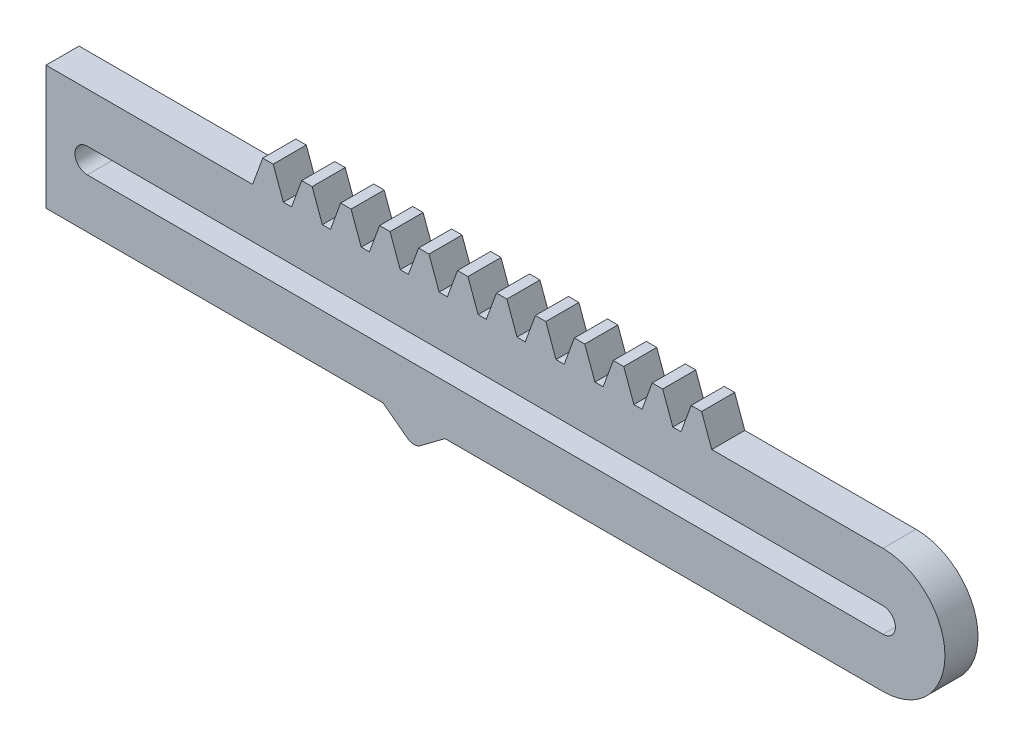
ISO-10303-21;
HEADER;
FILE_DESCRIPTION(('STEP AP214'),'2;1');
FILE_NAME('part.step','',(''),(''),'','','');
FILE_SCHEMA(('AUTOMOTIVE_DESIGN { 1 0 10303 214 1 1 1 1 }'));
ENDSEC;
DATA;
#1=APPLICATION_CONTEXT('core data for automotive mechanical design processes');
#2=APPLICATION_PROTOCOL_DEFINITION('international standard','automotive_design',2000,#1);
#3=PRODUCT_CONTEXT('',#1,'mechanical');
#4=PRODUCT('Part','Part','',(#3));
#5=PRODUCT_RELATED_PRODUCT_CATEGORY('part','',(#4));
#6=PRODUCT_DEFINITION_FORMATION('','',#4);
#7=PRODUCT_DEFINITION_CONTEXT('part definition',#1,'design');
#8=PRODUCT_DEFINITION('design','',#6,#7);
#9=PRODUCT_DEFINITION_SHAPE('','',#8);
#10=(LENGTH_UNIT() NAMED_UNIT(*) SI_UNIT(.MILLI.,.METRE.));
#11=(NAMED_UNIT(*) PLANE_ANGLE_UNIT() SI_UNIT($,.RADIAN.));
#12=(NAMED_UNIT(*) SI_UNIT($,.STERADIAN.) SOLID_ANGLE_UNIT());
#13=UNCERTAINTY_MEASURE_WITH_UNIT(LENGTH_MEASURE(1.E-05),#10,'distance_accuracy_value','');
#14=(GEOMETRIC_REPRESENTATION_CONTEXT(3) GLOBAL_UNCERTAINTY_ASSIGNED_CONTEXT((#13)) GLOBAL_UNIT_ASSIGNED_CONTEXT((#10,
#11,#12)) REPRESENTATION_CONTEXT('',''));
#15=CARTESIAN_POINT('',(0.,0.,0.));
#16=DIRECTION('',(0.,0.,1.));
#17=DIRECTION('',(1.,0.,0.));
#18=AXIS2_PLACEMENT_3D('',#15,#16,#17);
#19=CARTESIAN_POINT('',(148.823144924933,0.,8.));
#20=DIRECTION('',(0.,0.,-1.));
#21=DIRECTION('',(-1.,0.,0.));
#22=AXIS2_PLACEMENT_3D('',#19,#20,#21);
#23=PLANE('',#22);
#24=DIRECTION('',(-1.,0.,0.));
#25=VECTOR('',#24,1.);
#26=CARTESIAN_POINT('',(-1.2642837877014,21.75,8.));
#27=LINE('',#26,#25);
#28=CARTESIAN_POINT('',(1.2642837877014,21.75,8.));
#29=VERTEX_POINT('',#28);
#30=CARTESIAN_POINT('',(-1.2642837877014,21.75,8.));
#31=VERTEX_POINT('',#30);
#32=EDGE_CURVE('E452',#29,#31,#27,.T.);
#33=ORIENTED_EDGE('',*,*,#32,.T.);
#34=DIRECTION('',(-0.342020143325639,-0.939692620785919,0.));
#35=VECTOR('',#34,1.);
#36=CARTESIAN_POINT('',(-3.72108286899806,14.9999999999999,8.));
#37=LINE('',#36,#35);
#38=CARTESIAN_POINT('',(-3.72108286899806,14.9999999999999,8.));
#39=VERTEX_POINT('',#38);
#40=EDGE_CURVE('E455',#31,#39,#37,.T.);
#41=ORIENTED_EDGE('',*,*,#40,.T.);
#42=DIRECTION('',(-1.,0.,0.));
#43=VECTOR('',#42,1.);
#44=CARTESIAN_POINT('',(-3.72108286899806,14.9999999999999,8.));
#45=LINE('',#44,#43);
#46=CARTESIAN_POINT('',(-53.7210828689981,14.9999999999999,8.));
#47=VERTEX_POINT('',#46);
#48=EDGE_CURVE('E458',#39,#47,#45,.T.);
#49=ORIENTED_EDGE('',*,*,#48,.T.);
#50=DIRECTION('',(0.,-1.,0.));
#51=VECTOR('',#50,1.);
#52=CARTESIAN_POINT('',(-53.7210828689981,14.9999999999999,8.));
#53=LINE('',#52,#51);
#54=CARTESIAN_POINT('',(-53.7210828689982,-15.,8.));
#55=VERTEX_POINT('',#54);
#56=EDGE_CURVE('E460',#47,#55,#53,.T.);
#57=ORIENTED_EDGE('',*,*,#56,.T.);
#58=DIRECTION('',(1.,0.,0.));
#59=VECTOR('',#58,1.);
#60=CARTESIAN_POINT('',(-53.7210828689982,-15.,8.));
#61=LINE('',#60,#59);
#62=CARTESIAN_POINT('',(27.8231449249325,-14.9999999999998,8.));
#63=VERTEX_POINT('',#62);
#64=EDGE_CURVE('E462',#55,#63,#61,.T.);
#65=ORIENTED_EDGE('',*,*,#64,.T.);
#66=DIRECTION('',(0.799999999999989,-0.600000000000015,0.));
#67=VECTOR('',#66,1.);
#68=CARTESIAN_POINT('',(27.8231449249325,-14.9999999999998,8.));
#69=LINE('',#68,#67);
#70=CARTESIAN_POINT('',(33.8231449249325,-19.5,8.));
#71=VERTEX_POINT('',#70);
#72=EDGE_CURVE('E464',#63,#71,#69,.T.);
#73=ORIENTED_EDGE('',*,*,#72,.T.);
#74=CARTESIAN_POINT('',(35.3231449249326,-17.5,8.));
#75=DIRECTION('',(0.,0.,1.));
#76=DIRECTION('',(1.,0.,0.));
#77=AXIS2_PLACEMENT_3D('',#74,#75,#76);
#78=CIRCLE('',#77,2.50000000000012);
#79=CARTESIAN_POINT('',(36.8231449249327,-19.5,8.));
#80=VERTEX_POINT('',#79);
#81=EDGE_CURVE('E466',#71,#80,#78,.T.);
#82=ORIENTED_EDGE('',*,*,#81,.T.);
#83=DIRECTION('',(0.799999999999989,0.600000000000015,0.));
#84=VECTOR('',#83,1.);
#85=CARTESIAN_POINT('',(42.8231449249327,-14.9999999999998,8.));
#86=LINE('',#85,#84);
#87=CARTESIAN_POINT('',(42.8231449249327,-14.9999999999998,8.));
#88=VERTEX_POINT('',#87);
#89=EDGE_CURVE('E468',#80,#88,#86,.T.);
#90=ORIENTED_EDGE('',*,*,#89,.T.);
#91=DIRECTION('',(1.,0.,0.));
#92=VECTOR('',#91,1.);
#93=CARTESIAN_POINT('',(42.8231449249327,-14.9999999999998,8.));
#94=LINE('',#93,#92);
#95=CARTESIAN_POINT('',(148.823144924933,-14.9999999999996,8.));
#96=VERTEX_POINT('',#95);
#97=EDGE_CURVE('E470',#88,#96,#94,.T.);
#98=ORIENTED_EDGE('',*,*,#97,.T.);
#99=CARTESIAN_POINT('',(148.823144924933,0.,8.));
#100=DIRECTION('',(0.,0.,1.));
#101=DIRECTION('',(-1.,0.,0.));
#102=AXIS2_PLACEMENT_3D('',#99,#100,#101);
#103=CIRCLE('',#102,14.9999999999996);
#104=CARTESIAN_POINT('',(148.823144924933,14.9999999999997,8.));
#105=VERTEX_POINT('',#104);
#106=EDGE_CURVE('E472',#96,#105,#103,.T.);
#107=ORIENTED_EDGE('',*,*,#106,.T.);
#108=DIRECTION('',(-1.,0.,0.));
#109=VECTOR('',#108,1.);
#110=CARTESIAN_POINT('',(107.393640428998,15.,8.));
#111=LINE('',#110,#109);
#112=CARTESIAN_POINT('',(107.393640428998,15.,8.));
#113=VERTEX_POINT('',#112);
#114=EDGE_CURVE('E474',#105,#113,#111,.T.);
#115=ORIENTED_EDGE('',*,*,#114,.T.);
#116=DIRECTION('',(-0.342020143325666,0.93969262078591,0.));
#117=VECTOR('',#116,1.);
#118=CARTESIAN_POINT('',(107.393640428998,15.,8.));
#119=LINE('',#118,#117);
#120=CARTESIAN_POINT('',(104.936841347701,21.75,8.));
#121=VERTEX_POINT('',#120);
#122=EDGE_CURVE('E476',#113,#121,#119,.T.);
#123=ORIENTED_EDGE('',*,*,#122,.T.);
#124=DIRECTION('',(-1.,0.,0.));
#125=VECTOR('',#124,1.);
#126=CARTESIAN_POINT('',(102.408273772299,21.75,8.));
#127=LINE('',#126,#125);
#128=CARTESIAN_POINT('',(102.408273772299,21.75,8.));
#129=VERTEX_POINT('',#128);
#130=EDGE_CURVE('E478',#121,#129,#127,.T.);
#131=ORIENTED_EDGE('',*,*,#130,.T.);
#132=DIRECTION('',(-0.342020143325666,-0.93969262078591,0.));
#133=VECTOR('',#132,1.);
#134=CARTESIAN_POINT('',(99.9514746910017,15.,8.));
#135=LINE('',#134,#133);
#136=CARTESIAN_POINT('',(99.9514746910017,15.,8.));
#137=VERTEX_POINT('',#136);
#138=EDGE_CURVE('E480',#129,#137,#135,.T.);
#139=ORIENTED_EDGE('',*,*,#138,.T.);
#140=DIRECTION('',(-1.,0.,0.));
#141=VECTOR('',#140,1.);
#142=CARTESIAN_POINT('',(97.9688624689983,15.,8.));
#143=LINE('',#142,#141);
#144=CARTESIAN_POINT('',(97.9688624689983,15.,8.));
#145=VERTEX_POINT('',#144);
#146=EDGE_CURVE('E482',#137,#145,#143,.T.);
#147=ORIENTED_EDGE('',*,*,#146,.T.);
#148=DIRECTION('',(-0.342020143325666,0.93969262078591,0.));
#149=VECTOR('',#148,1.);
#150=CARTESIAN_POINT('',(97.9688624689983,15.,8.));
#151=LINE('',#150,#149);
#152=CARTESIAN_POINT('',(95.5120633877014,21.75,8.));
#153=VERTEX_POINT('',#152);
#154=EDGE_CURVE('E484',#145,#153,#151,.T.);
#155=ORIENTED_EDGE('',*,*,#154,.T.);
#156=DIRECTION('',(-1.,0.,0.));
#157=VECTOR('',#156,1.);
#158=CARTESIAN_POINT('',(92.9834958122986,21.75,8.));
#159=LINE('',#158,#157);
#160=CARTESIAN_POINT('',(92.9834958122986,21.75,8.));
#161=VERTEX_POINT('',#160);
#162=EDGE_CURVE('E486',#153,#161,#159,.T.);
#163=ORIENTED_EDGE('',*,*,#162,.T.);
#164=DIRECTION('',(-0.342020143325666,-0.93969262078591,0.));
#165=VECTOR('',#164,1.);
#166=CARTESIAN_POINT('',(90.5266967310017,15.,8.));
#167=LINE('',#166,#165);
#168=CARTESIAN_POINT('',(90.5266967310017,15.,8.));
#169=VERTEX_POINT('',#168);
#170=EDGE_CURVE('E488',#161,#169,#167,.T.);
#171=ORIENTED_EDGE('',*,*,#170,.T.);
#172=DIRECTION('',(-1.,0.,0.));
#173=VECTOR('',#172,1.);
#174=CARTESIAN_POINT('',(88.5440845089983,15.,8.));
#175=LINE('',#174,#173);
#176=CARTESIAN_POINT('',(88.5440845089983,15.,8.));
#177=VERTEX_POINT('',#176);
#178=EDGE_CURVE('E490',#169,#177,#175,.T.);
#179=ORIENTED_EDGE('',*,*,#178,.T.);
#180=DIRECTION('',(-0.342020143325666,0.93969262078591,0.));
#181=VECTOR('',#180,1.);
#182=CARTESIAN_POINT('',(88.5440845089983,15.,8.));
#183=LINE('',#182,#181);
#184=CARTESIAN_POINT('',(86.0872854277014,21.75,8.));
#185=VERTEX_POINT('',#184);
#186=EDGE_CURVE('E492',#177,#185,#183,.T.);
#187=ORIENTED_EDGE('',*,*,#186,.T.);
#188=DIRECTION('',(-1.,0.,0.));
#189=VECTOR('',#188,1.);
#190=CARTESIAN_POINT('',(83.5587178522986,21.75,8.));
#191=LINE('',#190,#189);
#192=CARTESIAN_POINT('',(83.5587178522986,21.75,8.));
#193=VERTEX_POINT('',#192);
#194=EDGE_CURVE('E494',#185,#193,#191,.T.);
#195=ORIENTED_EDGE('',*,*,#194,.T.);
#196=DIRECTION('',(-0.342020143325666,-0.93969262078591,0.));
#197=VECTOR('',#196,1.);
#198=CARTESIAN_POINT('',(81.1019187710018,15.,8.));
#199=LINE('',#198,#197);
#200=CARTESIAN_POINT('',(81.1019187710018,15.,8.));
#201=VERTEX_POINT('',#200);
#202=EDGE_CURVE('E496',#193,#201,#199,.T.);
#203=ORIENTED_EDGE('',*,*,#202,.T.);
#204=DIRECTION('',(-1.,0.,0.));
#205=VECTOR('',#204,1.);
#206=CARTESIAN_POINT('',(79.1193065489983,15.,8.));
#207=LINE('',#206,#205);
#208=CARTESIAN_POINT('',(79.1193065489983,15.,8.));
#209=VERTEX_POINT('',#208);
#210=EDGE_CURVE('E498',#201,#209,#207,.T.);
#211=ORIENTED_EDGE('',*,*,#210,.T.);
#212=DIRECTION('',(-0.342020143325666,0.93969262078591,0.));
#213=VECTOR('',#212,1.);
#214=CARTESIAN_POINT('',(79.1193065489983,15.,8.));
#215=LINE('',#214,#213);
#216=CARTESIAN_POINT('',(76.6625074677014,21.75,8.));
#217=VERTEX_POINT('',#216);
#218=EDGE_CURVE('E500',#209,#217,#215,.T.);
#219=ORIENTED_EDGE('',*,*,#218,.T.);
#220=DIRECTION('',(-1.,0.,0.));
#221=VECTOR('',#220,1.);
#222=CARTESIAN_POINT('',(74.1339398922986,21.75,8.));
#223=LINE('',#222,#221);
#224=CARTESIAN_POINT('',(74.1339398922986,21.75,8.));
#225=VERTEX_POINT('',#224);
#226=EDGE_CURVE('E502',#217,#225,#223,.T.);
#227=ORIENTED_EDGE('',*,*,#226,.T.);
#228=DIRECTION('',(-0.342020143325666,-0.93969262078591,0.));
#229=VECTOR('',#228,1.);
#230=CARTESIAN_POINT('',(71.6771408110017,15.,8.));
#231=LINE('',#230,#229);
#232=CARTESIAN_POINT('',(71.6771408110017,15.,8.));
#233=VERTEX_POINT('',#232);
#234=EDGE_CURVE('E504',#225,#233,#231,.T.);
#235=ORIENTED_EDGE('',*,*,#234,.T.);
#236=DIRECTION('',(-1.,0.,0.));
#237=VECTOR('',#236,1.);
#238=CARTESIAN_POINT('',(69.6945285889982,15.,8.));
#239=LINE('',#238,#237);
#240=CARTESIAN_POINT('',(69.6945285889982,15.,8.));
#241=VERTEX_POINT('',#240);
#242=EDGE_CURVE('E506',#233,#241,#239,.T.);
#243=ORIENTED_EDGE('',*,*,#242,.T.);
#244=DIRECTION('',(-0.342020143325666,0.93969262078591,0.));
#245=VECTOR('',#244,1.);
#246=CARTESIAN_POINT('',(69.6945285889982,15.,8.));
#247=LINE('',#246,#245);
#248=CARTESIAN_POINT('',(67.2377295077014,21.75,8.));
#249=VERTEX_POINT('',#248);
#250=EDGE_CURVE('E508',#241,#249,#247,.T.);
#251=ORIENTED_EDGE('',*,*,#250,.T.);
#252=DIRECTION('',(-1.,0.,0.));
#253=VECTOR('',#252,1.);
#254=CARTESIAN_POINT('',(64.7091619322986,21.75,8.));
#255=LINE('',#254,#253);
#256=CARTESIAN_POINT('',(64.7091619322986,21.75,8.));
#257=VERTEX_POINT('',#256);
#258=EDGE_CURVE('E510',#249,#257,#255,.T.);
#259=ORIENTED_EDGE('',*,*,#258,.T.);
#260=DIRECTION('',(-0.342020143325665,-0.93969262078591,0.));
#261=VECTOR('',#260,1.);
#262=CARTESIAN_POINT('',(62.2523628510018,15.,8.));
#263=LINE('',#262,#261);
#264=CARTESIAN_POINT('',(62.2523628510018,15.,8.));
#265=VERTEX_POINT('',#264);
#266=EDGE_CURVE('E512',#257,#265,#263,.T.);
#267=ORIENTED_EDGE('',*,*,#266,.T.);
#268=DIRECTION('',(-1.,0.,0.));
#269=VECTOR('',#268,1.);
#270=CARTESIAN_POINT('',(60.2697506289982,15.,8.));
#271=LINE('',#270,#269);
#272=CARTESIAN_POINT('',(60.2697506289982,15.,8.));
#273=VERTEX_POINT('',#272);
#274=EDGE_CURVE('E514',#265,#273,#271,.T.);
#275=ORIENTED_EDGE('',*,*,#274,.T.);
#276=DIRECTION('',(-0.342020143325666,0.93969262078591,0.));
#277=VECTOR('',#276,1.);
#278=CARTESIAN_POINT('',(60.2697506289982,15.,8.));
#279=LINE('',#278,#277);
#280=CARTESIAN_POINT('',(57.8129515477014,21.75,8.));
#281=VERTEX_POINT('',#280);
#282=EDGE_CURVE('E516',#273,#281,#279,.T.);
#283=ORIENTED_EDGE('',*,*,#282,.T.);
#284=DIRECTION('',(-1.,0.,0.));
#285=VECTOR('',#284,1.);
#286=CARTESIAN_POINT('',(55.2843839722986,21.75,8.));
#287=LINE('',#286,#285);
#288=CARTESIAN_POINT('',(55.2843839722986,21.75,8.));
#289=VERTEX_POINT('',#288);
#290=EDGE_CURVE('E518',#281,#289,#287,.T.);
#291=ORIENTED_EDGE('',*,*,#290,.T.);
#292=DIRECTION('',(-0.342020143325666,-0.93969262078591,0.));
#293=VECTOR('',#292,1.);
#294=CARTESIAN_POINT('',(52.8275848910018,15.,8.));
#295=LINE('',#294,#293);
#296=CARTESIAN_POINT('',(52.8275848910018,15.,8.));
#297=VERTEX_POINT('',#296);
#298=EDGE_CURVE('E520',#289,#297,#295,.T.);
#299=ORIENTED_EDGE('',*,*,#298,.T.);
#300=DIRECTION('',(-1.,0.,0.));
#301=VECTOR('',#300,1.);
#302=CARTESIAN_POINT('',(50.8449726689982,15.,8.));
#303=LINE('',#302,#301);
#304=CARTESIAN_POINT('',(50.8449726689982,15.,8.));
#305=VERTEX_POINT('',#304);
#306=EDGE_CURVE('E522',#297,#305,#303,.T.);
#307=ORIENTED_EDGE('',*,*,#306,.T.);
#308=DIRECTION('',(-0.342020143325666,0.93969262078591,0.));
#309=VECTOR('',#308,1.);
#310=CARTESIAN_POINT('',(50.8449726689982,15.,8.));
#311=LINE('',#310,#309);
#312=CARTESIAN_POINT('',(48.3881735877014,21.75,8.));
#313=VERTEX_POINT('',#312);
#314=EDGE_CURVE('E524',#305,#313,#311,.T.);
#315=ORIENTED_EDGE('',*,*,#314,.T.);
#316=DIRECTION('',(-1.,0.,0.));
#317=VECTOR('',#316,1.);
#318=CARTESIAN_POINT('',(45.8596060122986,21.75,8.));
#319=LINE('',#318,#317);
#320=CARTESIAN_POINT('',(45.8596060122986,21.75,8.));
#321=VERTEX_POINT('',#320);
#322=EDGE_CURVE('E526',#313,#321,#319,.T.);
#323=ORIENTED_EDGE('',*,*,#322,.T.);
#324=DIRECTION('',(-0.342020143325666,-0.93969262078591,0.));
#325=VECTOR('',#324,1.);
#326=CARTESIAN_POINT('',(43.4028069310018,15.,8.));
#327=LINE('',#326,#325);
#328=CARTESIAN_POINT('',(43.4028069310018,15.,8.));
#329=VERTEX_POINT('',#328);
#330=EDGE_CURVE('E528',#321,#329,#327,.T.);
#331=ORIENTED_EDGE('',*,*,#330,.T.);
#332=DIRECTION('',(-1.,0.,0.));
#333=VECTOR('',#332,1.);
#334=CARTESIAN_POINT('',(41.4201947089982,15.,8.));
#335=LINE('',#334,#333);
#336=CARTESIAN_POINT('',(41.4201947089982,15.,8.));
#337=VERTEX_POINT('',#336);
#338=EDGE_CURVE('E530',#329,#337,#335,.T.);
#339=ORIENTED_EDGE('',*,*,#338,.T.);
#340=DIRECTION('',(-0.342020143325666,0.93969262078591,0.));
#341=VECTOR('',#340,1.);
#342=CARTESIAN_POINT('',(41.4201947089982,15.,8.));
#343=LINE('',#342,#341);
#344=CARTESIAN_POINT('',(38.9633956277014,21.75,8.));
#345=VERTEX_POINT('',#344);
#346=EDGE_CURVE('E532',#337,#345,#343,.T.);
#347=ORIENTED_EDGE('',*,*,#346,.T.);
#348=DIRECTION('',(-1.,0.,0.));
#349=VECTOR('',#348,1.);
#350=CARTESIAN_POINT('',(36.4348280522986,21.75,8.));
#351=LINE('',#350,#349);
#352=CARTESIAN_POINT('',(36.4348280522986,21.75,8.));
#353=VERTEX_POINT('',#352);
#354=EDGE_CURVE('E534',#345,#353,#351,.T.);
#355=ORIENTED_EDGE('',*,*,#354,.T.);
#356=DIRECTION('',(-0.342020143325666,-0.93969262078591,0.));
#357=VECTOR('',#356,1.);
#358=CARTESIAN_POINT('',(33.9780289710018,15.,8.));
#359=LINE('',#358,#357);
#360=CARTESIAN_POINT('',(33.9780289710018,15.,8.));
#361=VERTEX_POINT('',#360);
#362=EDGE_CURVE('E536',#353,#361,#359,.T.);
#363=ORIENTED_EDGE('',*,*,#362,.T.);
#364=DIRECTION('',(-1.,0.,0.));
#365=VECTOR('',#364,1.);
#366=CARTESIAN_POINT('',(31.9954167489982,15.,8.));
#367=LINE('',#366,#365);
#368=CARTESIAN_POINT('',(31.9954167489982,15.,8.));
#369=VERTEX_POINT('',#368);
#370=EDGE_CURVE('E538',#361,#369,#367,.T.);
#371=ORIENTED_EDGE('',*,*,#370,.T.);
#372=DIRECTION('',(-0.342020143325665,0.93969262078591,0.));
#373=VECTOR('',#372,1.);
#374=CARTESIAN_POINT('',(31.9954167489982,15.,8.));
#375=LINE('',#374,#373);
#376=CARTESIAN_POINT('',(29.5386176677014,21.75,8.));
#377=VERTEX_POINT('',#376);
#378=EDGE_CURVE('E540',#369,#377,#375,.T.);
#379=ORIENTED_EDGE('',*,*,#378,.T.);
#380=DIRECTION('',(-1.,0.,0.));
#381=VECTOR('',#380,1.);
#382=CARTESIAN_POINT('',(27.0100500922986,21.75,8.));
#383=LINE('',#382,#381);
#384=CARTESIAN_POINT('',(27.0100500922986,21.75,8.));
#385=VERTEX_POINT('',#384);
#386=EDGE_CURVE('E542',#377,#385,#383,.T.);
#387=ORIENTED_EDGE('',*,*,#386,.T.);
#388=DIRECTION('',(-0.342020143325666,-0.93969262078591,0.));
#389=VECTOR('',#388,1.);
#390=CARTESIAN_POINT('',(24.5532510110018,15.,8.));
#391=LINE('',#390,#389);
#392=CARTESIAN_POINT('',(24.5532510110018,15.,8.));
#393=VERTEX_POINT('',#392);
#394=EDGE_CURVE('E544',#385,#393,#391,.T.);
#395=ORIENTED_EDGE('',*,*,#394,.T.);
#396=DIRECTION('',(-1.,0.,0.));
#397=VECTOR('',#396,1.);
#398=CARTESIAN_POINT('',(22.5706387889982,15.,8.));
#399=LINE('',#398,#397);
#400=CARTESIAN_POINT('',(22.5706387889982,15.,8.));
#401=VERTEX_POINT('',#400);
#402=EDGE_CURVE('E546',#393,#401,#399,.T.);
#403=ORIENTED_EDGE('',*,*,#402,.T.);
#404=DIRECTION('',(-0.342020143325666,0.93969262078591,0.));
#405=VECTOR('',#404,1.);
#406=CARTESIAN_POINT('',(22.5706387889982,15.,8.));
#407=LINE('',#406,#405);
#408=CARTESIAN_POINT('',(20.1138397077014,21.75,8.));
#409=VERTEX_POINT('',#408);
#410=EDGE_CURVE('E548',#401,#409,#407,.T.);
#411=ORIENTED_EDGE('',*,*,#410,.T.);
#412=DIRECTION('',(-1.,0.,0.));
#413=VECTOR('',#412,1.);
#414=CARTESIAN_POINT('',(17.5852721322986,21.75,8.));
#415=LINE('',#414,#413);
#416=CARTESIAN_POINT('',(17.5852721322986,21.75,8.));
#417=VERTEX_POINT('',#416);
#418=EDGE_CURVE('E550',#409,#417,#415,.T.);
#419=ORIENTED_EDGE('',*,*,#418,.T.);
#420=DIRECTION('',(-0.342020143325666,-0.93969262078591,0.));
#421=VECTOR('',#420,1.);
#422=CARTESIAN_POINT('',(15.1284730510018,15.,8.));
#423=LINE('',#422,#421);
#424=CARTESIAN_POINT('',(15.1284730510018,15.,8.));
#425=VERTEX_POINT('',#424);
#426=EDGE_CURVE('E552',#417,#425,#423,.T.);
#427=ORIENTED_EDGE('',*,*,#426,.T.);
#428=DIRECTION('',(-1.,0.,0.));
#429=VECTOR('',#428,1.);
#430=CARTESIAN_POINT('',(13.1458608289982,15.,8.));
#431=LINE('',#430,#429);
#432=CARTESIAN_POINT('',(13.1458608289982,15.,8.));
#433=VERTEX_POINT('',#432);
#434=EDGE_CURVE('E554',#425,#433,#431,.T.);
#435=ORIENTED_EDGE('',*,*,#434,.T.);
#436=DIRECTION('',(-0.342020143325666,0.939692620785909,0.));
#437=VECTOR('',#436,1.);
#438=CARTESIAN_POINT('',(13.1458608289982,15.,8.));
#439=LINE('',#438,#437);
#440=CARTESIAN_POINT('',(10.6890617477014,21.75,8.));
#441=VERTEX_POINT('',#440);
#442=EDGE_CURVE('E556',#433,#441,#439,.T.);
#443=ORIENTED_EDGE('',*,*,#442,.T.);
#444=DIRECTION('',(-1.,0.,0.));
#445=VECTOR('',#444,1.);
#446=CARTESIAN_POINT('',(8.1604941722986,21.75,8.));
#447=LINE('',#446,#445);
#448=CARTESIAN_POINT('',(8.1604941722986,21.75,8.));
#449=VERTEX_POINT('',#448);
#450=EDGE_CURVE('E558',#441,#449,#447,.T.);
#451=ORIENTED_EDGE('',*,*,#450,.T.);
#452=DIRECTION('',(-0.342020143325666,-0.939692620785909,0.));
#453=VECTOR('',#452,1.);
#454=CARTESIAN_POINT('',(5.70369509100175,15.,8.));
#455=LINE('',#454,#453);
#456=CARTESIAN_POINT('',(5.70369509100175,15.,8.));
#457=VERTEX_POINT('',#456);
#458=EDGE_CURVE('E560',#449,#457,#455,.T.);
#459=ORIENTED_EDGE('',*,*,#458,.T.);
#460=DIRECTION('',(-1.,0.,0.));
#461=VECTOR('',#460,1.);
#462=CARTESIAN_POINT('',(3.7210828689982,15.,8.));
#463=LINE('',#462,#461);
#464=CARTESIAN_POINT('',(3.7210828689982,15.,8.));
#465=VERTEX_POINT('',#464);
#466=EDGE_CURVE('E562',#457,#465,#463,.T.);
#467=ORIENTED_EDGE('',*,*,#466,.T.);
#468=DIRECTION('',(-0.342020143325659,0.939692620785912,0.));
#469=VECTOR('',#468,1.);
#470=CARTESIAN_POINT('',(3.7210828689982,15.,8.));
#471=LINE('',#470,#469);
#472=EDGE_CURVE('E564',#465,#29,#471,.T.);
#473=ORIENTED_EDGE('',*,*,#472,.T.);
#474=EDGE_LOOP('',(#33,#41,#49,#57,#65,#73,#82,#90,#98,#107,#115,#123,#131,#139,#147,#155,#163,
#171,#179,#187,#195,#203,#211,#219,#227,#235,#243,#251,#259,#267,#275,#283,#291,#299,#307,#315,
#323,#331,#339,#347,#355,#363,#371,#379,#387,#395,#403,#411,#419,#427,#435,#443,#451,#459,#467,#473));
#475=FACE_BOUND('',#474,.T.);
#476=CARTESIAN_POINT('',(-43.7210828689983,0.,8.));
#477=DIRECTION('',(0.,0.,1.));
#478=DIRECTION('',(1.,0.,0.));
#479=AXIS2_PLACEMENT_3D('',#476,#477,#478);
#480=CIRCLE('',#479,3.);
#481=CARTESIAN_POINT('',(-43.7210828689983,3.00000000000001,8.));
#482=VERTEX_POINT('',#481);
#483=CARTESIAN_POINT('',(-43.7210828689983,-2.99999999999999,8.));
#484=VERTEX_POINT('',#483);
#485=EDGE_CURVE('E416',#482,#484,#480,.T.);
#486=ORIENTED_EDGE('',*,*,#485,.F.);
#487=DIRECTION('',(-1.,0.,0.));
#488=VECTOR('',#487,1.);
#489=CARTESIAN_POINT('',(-43.7210828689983,3.00000000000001,8.));
#490=LINE('',#489,#488);
#491=CARTESIAN_POINT('',(148.823144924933,3.00000000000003,8.));
#492=VERTEX_POINT('',#491);
#493=EDGE_CURVE('E438',#492,#482,#490,.T.);
#494=ORIENTED_EDGE('',*,*,#493,.F.);
#495=CARTESIAN_POINT('',(148.823144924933,0.,8.));
#496=DIRECTION('',(0.,0.,1.));
#497=DIRECTION('',(1.,0.,0.));
#498=AXIS2_PLACEMENT_3D('',#495,#496,#497);
#499=CIRCLE('',#498,2.99999999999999);
#500=CARTESIAN_POINT('',(148.823144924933,-2.99999999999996,8.));
#501=VERTEX_POINT('',#500);
#502=EDGE_CURVE('E436',#501,#492,#499,.T.);
#503=ORIENTED_EDGE('',*,*,#502,.F.);
#504=DIRECTION('',(1.,0.,0.));
#505=VECTOR('',#504,1.);
#506=CARTESIAN_POINT('',(-43.7210828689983,-2.99999999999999,8.));
#507=LINE('',#506,#505);
#508=EDGE_CURVE('E424',#484,#501,#507,.T.);
#509=ORIENTED_EDGE('',*,*,#508,.F.);
#510=EDGE_LOOP('',(#486,#494,#503,#509));
#511=FACE_BOUND('',#510,.T.);
#512=ADVANCED_FACE('F39',(#475,#511),#23,.F.);
#513=CARTESIAN_POINT('',(148.823144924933,0.,0.));
#514=DIRECTION('',(0.,0.,-1.));
#515=DIRECTION('',(-1.,0.,0.));
#516=AXIS2_PLACEMENT_3D('',#513,#514,#515);
#517=PLANE('',#516);
#518=DIRECTION('',(-1.,0.,0.));
#519=VECTOR('',#518,1.);
#520=CARTESIAN_POINT('',(-1.2642837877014,21.75,0.));
#521=LINE('',#520,#519);
#522=CARTESIAN_POINT('',(1.2642837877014,21.75,0.));
#523=VERTEX_POINT('',#522);
#524=CARTESIAN_POINT('',(-1.2642837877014,21.75,0.));
#525=VERTEX_POINT('',#524);
#526=EDGE_CURVE('E432',#523,#525,#521,.T.);
#527=ORIENTED_EDGE('',*,*,#526,.F.);
#528=DIRECTION('',(-0.342020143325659,0.939692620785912,0.));
#529=VECTOR('',#528,1.);
#530=CARTESIAN_POINT('',(3.7210828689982,15.,0.));
#531=LINE('',#530,#529);
#532=CARTESIAN_POINT('',(3.7210828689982,15.,0.));
#533=VERTEX_POINT('',#532);
#534=EDGE_CURVE('E456',#533,#523,#531,.T.);
#535=ORIENTED_EDGE('',*,*,#534,.F.);
#536=DIRECTION('',(-1.,0.,0.));
#537=VECTOR('',#536,1.);
#538=CARTESIAN_POINT('',(3.7210828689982,15.,0.));
#539=LINE('',#538,#537);
#540=CARTESIAN_POINT('',(5.70369509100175,15.,0.));
#541=VERTEX_POINT('',#540);
#542=EDGE_CURVE('E675',#541,#533,#539,.T.);
#543=ORIENTED_EDGE('',*,*,#542,.F.);
#544=DIRECTION('',(-0.342020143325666,-0.939692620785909,0.));
#545=VECTOR('',#544,1.);
#546=CARTESIAN_POINT('',(5.70369509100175,15.,0.));
#547=LINE('',#546,#545);
#548=CARTESIAN_POINT('',(8.1604941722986,21.75,0.));
#549=VERTEX_POINT('',#548);
#550=EDGE_CURVE('E673',#549,#541,#547,.T.);
#551=ORIENTED_EDGE('',*,*,#550,.F.);
#552=DIRECTION('',(-1.,0.,0.));
#553=VECTOR('',#552,1.);
#554=CARTESIAN_POINT('',(8.1604941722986,21.75,0.));
#555=LINE('',#554,#553);
#556=CARTESIAN_POINT('',(10.6890617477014,21.75,0.));
#557=VERTEX_POINT('',#556);
#558=EDGE_CURVE('E671',#557,#549,#555,.T.);
#559=ORIENTED_EDGE('',*,*,#558,.F.);
#560=DIRECTION('',(-0.342020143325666,0.939692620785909,0.));
#561=VECTOR('',#560,1.);
#562=CARTESIAN_POINT('',(13.1458608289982,15.,0.));
#563=LINE('',#562,#561);
#564=CARTESIAN_POINT('',(13.1458608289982,15.,0.));
#565=VERTEX_POINT('',#564);
#566=EDGE_CURVE('E669',#565,#557,#563,.T.);
#567=ORIENTED_EDGE('',*,*,#566,.F.);
#568=DIRECTION('',(-1.,0.,0.));
#569=VECTOR('',#568,1.);
#570=CARTESIAN_POINT('',(13.1458608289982,15.,0.));
#571=LINE('',#570,#569);
#572=CARTESIAN_POINT('',(15.1284730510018,15.,0.));
#573=VERTEX_POINT('',#572);
#574=EDGE_CURVE('E667',#573,#565,#571,.T.);
#575=ORIENTED_EDGE('',*,*,#574,.F.);
#576=DIRECTION('',(-0.342020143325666,-0.93969262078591,0.));
#577=VECTOR('',#576,1.);
#578=CARTESIAN_POINT('',(15.1284730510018,15.,0.));
#579=LINE('',#578,#577);
#580=CARTESIAN_POINT('',(17.5852721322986,21.75,0.));
#581=VERTEX_POINT('',#580);
#582=EDGE_CURVE('E665',#581,#573,#579,.T.);
#583=ORIENTED_EDGE('',*,*,#582,.F.);
#584=DIRECTION('',(-1.,0.,0.));
#585=VECTOR('',#584,1.);
#586=CARTESIAN_POINT('',(17.5852721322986,21.75,0.));
#587=LINE('',#586,#585);
#588=CARTESIAN_POINT('',(20.1138397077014,21.75,0.));
#589=VERTEX_POINT('',#588);
#590=EDGE_CURVE('E663',#589,#581,#587,.T.);
#591=ORIENTED_EDGE('',*,*,#590,.F.);
#592=DIRECTION('',(-0.342020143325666,0.93969262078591,0.));
#593=VECTOR('',#592,1.);
#594=CARTESIAN_POINT('',(22.5706387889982,15.,0.));
#595=LINE('',#594,#593);
#596=CARTESIAN_POINT('',(22.5706387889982,15.,0.));
#597=VERTEX_POINT('',#596);
#598=EDGE_CURVE('E661',#597,#589,#595,.T.);
#599=ORIENTED_EDGE('',*,*,#598,.F.);
#600=DIRECTION('',(-1.,0.,0.));
#601=VECTOR('',#600,1.);
#602=CARTESIAN_POINT('',(22.5706387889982,15.,0.));
#603=LINE('',#602,#601);
#604=CARTESIAN_POINT('',(24.5532510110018,15.,0.));
#605=VERTEX_POINT('',#604);
#606=EDGE_CURVE('E659',#605,#597,#603,.T.);
#607=ORIENTED_EDGE('',*,*,#606,.F.);
#608=DIRECTION('',(-0.342020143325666,-0.93969262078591,0.));
#609=VECTOR('',#608,1.);
#610=CARTESIAN_POINT('',(24.5532510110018,15.,0.));
#611=LINE('',#610,#609);
#612=CARTESIAN_POINT('',(27.0100500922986,21.75,0.));
#613=VERTEX_POINT('',#612);
#614=EDGE_CURVE('E657',#613,#605,#611,.T.);
#615=ORIENTED_EDGE('',*,*,#614,.F.);
#616=DIRECTION('',(-1.,0.,0.));
#617=VECTOR('',#616,1.);
#618=CARTESIAN_POINT('',(27.0100500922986,21.75,0.));
#619=LINE('',#618,#617);
#620=CARTESIAN_POINT('',(29.5386176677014,21.75,0.));
#621=VERTEX_POINT('',#620);
#622=EDGE_CURVE('E655',#621,#613,#619,.T.);
#623=ORIENTED_EDGE('',*,*,#622,.F.);
#624=DIRECTION('',(-0.342020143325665,0.93969262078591,0.));
#625=VECTOR('',#624,1.);
#626=CARTESIAN_POINT('',(31.9954167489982,15.,0.));
#627=LINE('',#626,#625);
#628=CARTESIAN_POINT('',(31.9954167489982,15.,0.));
#629=VERTEX_POINT('',#628);
#630=EDGE_CURVE('E653',#629,#621,#627,.T.);
#631=ORIENTED_EDGE('',*,*,#630,.F.);
#632=DIRECTION('',(-1.,0.,0.));
#633=VECTOR('',#632,1.);
#634=CARTESIAN_POINT('',(31.9954167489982,15.,0.));
#635=LINE('',#634,#633);
#636=CARTESIAN_POINT('',(33.9780289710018,15.,0.));
#637=VERTEX_POINT('',#636);
#638=EDGE_CURVE('E651',#637,#629,#635,.T.);
#639=ORIENTED_EDGE('',*,*,#638,.F.);
#640=DIRECTION('',(-0.342020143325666,-0.93969262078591,0.));
#641=VECTOR('',#640,1.);
#642=CARTESIAN_POINT('',(33.9780289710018,15.,0.));
#643=LINE('',#642,#641);
#644=CARTESIAN_POINT('',(36.4348280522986,21.75,0.));
#645=VERTEX_POINT('',#644);
#646=EDGE_CURVE('E649',#645,#637,#643,.T.);
#647=ORIENTED_EDGE('',*,*,#646,.F.);
#648=DIRECTION('',(-1.,0.,0.));
#649=VECTOR('',#648,1.);
#650=CARTESIAN_POINT('',(36.4348280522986,21.75,0.));
#651=LINE('',#650,#649);
#652=CARTESIAN_POINT('',(38.9633956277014,21.75,0.));
#653=VERTEX_POINT('',#652);
#654=EDGE_CURVE('E647',#653,#645,#651,.T.);
#655=ORIENTED_EDGE('',*,*,#654,.F.);
#656=DIRECTION('',(-0.342020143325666,0.93969262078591,0.));
#657=VECTOR('',#656,1.);
#658=CARTESIAN_POINT('',(41.4201947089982,15.,0.));
#659=LINE('',#658,#657);
#660=CARTESIAN_POINT('',(41.4201947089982,15.,0.));
#661=VERTEX_POINT('',#660);
#662=EDGE_CURVE('E645',#661,#653,#659,.T.);
#663=ORIENTED_EDGE('',*,*,#662,.F.);
#664=DIRECTION('',(-1.,0.,0.));
#665=VECTOR('',#664,1.);
#666=CARTESIAN_POINT('',(41.4201947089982,15.,0.));
#667=LINE('',#666,#665);
#668=CARTESIAN_POINT('',(43.4028069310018,15.,0.));
#669=VERTEX_POINT('',#668);
#670=EDGE_CURVE('E643',#669,#661,#667,.T.);
#671=ORIENTED_EDGE('',*,*,#670,.F.);
#672=DIRECTION('',(-0.342020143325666,-0.93969262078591,0.));
#673=VECTOR('',#672,1.);
#674=CARTESIAN_POINT('',(43.4028069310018,15.,0.));
#675=LINE('',#674,#673);
#676=CARTESIAN_POINT('',(45.8596060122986,21.75,0.));
#677=VERTEX_POINT('',#676);
#678=EDGE_CURVE('E641',#677,#669,#675,.T.);
#679=ORIENTED_EDGE('',*,*,#678,.F.);
#680=DIRECTION('',(-1.,0.,0.));
#681=VECTOR('',#680,1.);
#682=CARTESIAN_POINT('',(45.8596060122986,21.75,0.));
#683=LINE('',#682,#681);
#684=CARTESIAN_POINT('',(48.3881735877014,21.75,0.));
#685=VERTEX_POINT('',#684);
#686=EDGE_CURVE('E639',#685,#677,#683,.T.);
#687=ORIENTED_EDGE('',*,*,#686,.F.);
#688=DIRECTION('',(-0.342020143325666,0.93969262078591,0.));
#689=VECTOR('',#688,1.);
#690=CARTESIAN_POINT('',(50.8449726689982,15.,0.));
#691=LINE('',#690,#689);
#692=CARTESIAN_POINT('',(50.8449726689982,15.,0.));
#693=VERTEX_POINT('',#692);
#694=EDGE_CURVE('E637',#693,#685,#691,.T.);
#695=ORIENTED_EDGE('',*,*,#694,.F.);
#696=DIRECTION('',(-1.,0.,0.));
#697=VECTOR('',#696,1.);
#698=CARTESIAN_POINT('',(50.8449726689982,15.,0.));
#699=LINE('',#698,#697);
#700=CARTESIAN_POINT('',(52.8275848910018,15.,0.));
#701=VERTEX_POINT('',#700);
#702=EDGE_CURVE('E635',#701,#693,#699,.T.);
#703=ORIENTED_EDGE('',*,*,#702,.F.);
#704=DIRECTION('',(-0.342020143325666,-0.93969262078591,0.));
#705=VECTOR('',#704,1.);
#706=CARTESIAN_POINT('',(52.8275848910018,15.,0.));
#707=LINE('',#706,#705);
#708=CARTESIAN_POINT('',(55.2843839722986,21.75,0.));
#709=VERTEX_POINT('',#708);
#710=EDGE_CURVE('E633',#709,#701,#707,.T.);
#711=ORIENTED_EDGE('',*,*,#710,.F.);
#712=DIRECTION('',(-1.,0.,0.));
#713=VECTOR('',#712,1.);
#714=CARTESIAN_POINT('',(55.2843839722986,21.75,0.));
#715=LINE('',#714,#713);
#716=CARTESIAN_POINT('',(57.8129515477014,21.75,0.));
#717=VERTEX_POINT('',#716);
#718=EDGE_CURVE('E631',#717,#709,#715,.T.);
#719=ORIENTED_EDGE('',*,*,#718,.F.);
#720=DIRECTION('',(-0.342020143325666,0.93969262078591,0.));
#721=VECTOR('',#720,1.);
#722=CARTESIAN_POINT('',(60.2697506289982,15.,0.));
#723=LINE('',#722,#721);
#724=CARTESIAN_POINT('',(60.2697506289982,15.,0.));
#725=VERTEX_POINT('',#724);
#726=EDGE_CURVE('E629',#725,#717,#723,.T.);
#727=ORIENTED_EDGE('',*,*,#726,.F.);
#728=DIRECTION('',(-1.,0.,0.));
#729=VECTOR('',#728,1.);
#730=CARTESIAN_POINT('',(60.2697506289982,15.,0.));
#731=LINE('',#730,#729);
#732=CARTESIAN_POINT('',(62.2523628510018,15.,0.));
#733=VERTEX_POINT('',#732);
#734=EDGE_CURVE('E627',#733,#725,#731,.T.);
#735=ORIENTED_EDGE('',*,*,#734,.F.);
#736=DIRECTION('',(-0.342020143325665,-0.93969262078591,0.));
#737=VECTOR('',#736,1.);
#738=CARTESIAN_POINT('',(62.2523628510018,15.,0.));
#739=LINE('',#738,#737);
#740=CARTESIAN_POINT('',(64.7091619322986,21.75,0.));
#741=VERTEX_POINT('',#740);
#742=EDGE_CURVE('E625',#741,#733,#739,.T.);
#743=ORIENTED_EDGE('',*,*,#742,.F.);
#744=DIRECTION('',(-1.,0.,0.));
#745=VECTOR('',#744,1.);
#746=CARTESIAN_POINT('',(64.7091619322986,21.75,0.));
#747=LINE('',#746,#745);
#748=CARTESIAN_POINT('',(67.2377295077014,21.75,0.));
#749=VERTEX_POINT('',#748);
#750=EDGE_CURVE('E623',#749,#741,#747,.T.);
#751=ORIENTED_EDGE('',*,*,#750,.F.);
#752=DIRECTION('',(-0.342020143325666,0.93969262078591,0.));
#753=VECTOR('',#752,1.);
#754=CARTESIAN_POINT('',(69.6945285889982,15.,0.));
#755=LINE('',#754,#753);
#756=CARTESIAN_POINT('',(69.6945285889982,15.,0.));
#757=VERTEX_POINT('',#756);
#758=EDGE_CURVE('E621',#757,#749,#755,.T.);
#759=ORIENTED_EDGE('',*,*,#758,.F.);
#760=DIRECTION('',(-1.,0.,0.));
#761=VECTOR('',#760,1.);
#762=CARTESIAN_POINT('',(69.6945285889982,15.,0.));
#763=LINE('',#762,#761);
#764=CARTESIAN_POINT('',(71.6771408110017,15.,0.));
#765=VERTEX_POINT('',#764);
#766=EDGE_CURVE('E619',#765,#757,#763,.T.);
#767=ORIENTED_EDGE('',*,*,#766,.F.);
#768=DIRECTION('',(-0.342020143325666,-0.93969262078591,0.));
#769=VECTOR('',#768,1.);
#770=CARTESIAN_POINT('',(71.6771408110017,15.,0.));
#771=LINE('',#770,#769);
#772=CARTESIAN_POINT('',(74.1339398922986,21.75,0.));
#773=VERTEX_POINT('',#772);
#774=EDGE_CURVE('E617',#773,#765,#771,.T.);
#775=ORIENTED_EDGE('',*,*,#774,.F.);
#776=DIRECTION('',(-1.,0.,0.));
#777=VECTOR('',#776,1.);
#778=CARTESIAN_POINT('',(74.1339398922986,21.75,0.));
#779=LINE('',#778,#777);
#780=CARTESIAN_POINT('',(76.6625074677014,21.75,0.));
#781=VERTEX_POINT('',#780);
#782=EDGE_CURVE('E615',#781,#773,#779,.T.);
#783=ORIENTED_EDGE('',*,*,#782,.F.);
#784=DIRECTION('',(-0.342020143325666,0.93969262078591,0.));
#785=VECTOR('',#784,1.);
#786=CARTESIAN_POINT('',(79.1193065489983,15.,0.));
#787=LINE('',#786,#785);
#788=CARTESIAN_POINT('',(79.1193065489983,15.,0.));
#789=VERTEX_POINT('',#788);
#790=EDGE_CURVE('E613',#789,#781,#787,.T.);
#791=ORIENTED_EDGE('',*,*,#790,.F.);
#792=DIRECTION('',(-1.,0.,0.));
#793=VECTOR('',#792,1.);
#794=CARTESIAN_POINT('',(79.1193065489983,15.,0.));
#795=LINE('',#794,#793);
#796=CARTESIAN_POINT('',(81.1019187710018,15.,0.));
#797=VERTEX_POINT('',#796);
#798=EDGE_CURVE('E611',#797,#789,#795,.T.);
#799=ORIENTED_EDGE('',*,*,#798,.F.);
#800=DIRECTION('',(-0.342020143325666,-0.93969262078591,0.));
#801=VECTOR('',#800,1.);
#802=CARTESIAN_POINT('',(81.1019187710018,15.,0.));
#803=LINE('',#802,#801);
#804=CARTESIAN_POINT('',(83.5587178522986,21.75,0.));
#805=VERTEX_POINT('',#804);
#806=EDGE_CURVE('E609',#805,#797,#803,.T.);
#807=ORIENTED_EDGE('',*,*,#806,.F.);
#808=DIRECTION('',(-1.,0.,0.));
#809=VECTOR('',#808,1.);
#810=CARTESIAN_POINT('',(83.5587178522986,21.75,0.));
#811=LINE('',#810,#809);
#812=CARTESIAN_POINT('',(86.0872854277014,21.75,0.));
#813=VERTEX_POINT('',#812);
#814=EDGE_CURVE('E607',#813,#805,#811,.T.);
#815=ORIENTED_EDGE('',*,*,#814,.F.);
#816=DIRECTION('',(-0.342020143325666,0.93969262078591,0.));
#817=VECTOR('',#816,1.);
#818=CARTESIAN_POINT('',(88.5440845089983,15.,0.));
#819=LINE('',#818,#817);
#820=CARTESIAN_POINT('',(88.5440845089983,15.,0.));
#821=VERTEX_POINT('',#820);
#822=EDGE_CURVE('E605',#821,#813,#819,.T.);
#823=ORIENTED_EDGE('',*,*,#822,.F.);
#824=DIRECTION('',(-1.,0.,0.));
#825=VECTOR('',#824,1.);
#826=CARTESIAN_POINT('',(88.5440845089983,15.,0.));
#827=LINE('',#826,#825);
#828=CARTESIAN_POINT('',(90.5266967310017,15.,0.));
#829=VERTEX_POINT('',#828);
#830=EDGE_CURVE('E603',#829,#821,#827,.T.);
#831=ORIENTED_EDGE('',*,*,#830,.F.);
#832=DIRECTION('',(-0.342020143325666,-0.93969262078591,0.));
#833=VECTOR('',#832,1.);
#834=CARTESIAN_POINT('',(90.5266967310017,15.,0.));
#835=LINE('',#834,#833);
#836=CARTESIAN_POINT('',(92.9834958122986,21.75,0.));
#837=VERTEX_POINT('',#836);
#838=EDGE_CURVE('E601',#837,#829,#835,.T.);
#839=ORIENTED_EDGE('',*,*,#838,.F.);
#840=DIRECTION('',(-1.,0.,0.));
#841=VECTOR('',#840,1.);
#842=CARTESIAN_POINT('',(92.9834958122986,21.75,0.));
#843=LINE('',#842,#841);
#844=CARTESIAN_POINT('',(95.5120633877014,21.75,0.));
#845=VERTEX_POINT('',#844);
#846=EDGE_CURVE('E599',#845,#837,#843,.T.);
#847=ORIENTED_EDGE('',*,*,#846,.F.);
#848=DIRECTION('',(-0.342020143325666,0.93969262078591,0.));
#849=VECTOR('',#848,1.);
#850=CARTESIAN_POINT('',(97.9688624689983,15.,0.));
#851=LINE('',#850,#849);
#852=CARTESIAN_POINT('',(97.9688624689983,15.,0.));
#853=VERTEX_POINT('',#852);
#854=EDGE_CURVE('E597',#853,#845,#851,.T.);
#855=ORIENTED_EDGE('',*,*,#854,.F.);
#856=DIRECTION('',(-1.,0.,0.));
#857=VECTOR('',#856,1.);
#858=CARTESIAN_POINT('',(97.9688624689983,15.,0.));
#859=LINE('',#858,#857);
#860=CARTESIAN_POINT('',(99.9514746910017,15.,0.));
#861=VERTEX_POINT('',#860);
#862=EDGE_CURVE('E595',#861,#853,#859,.T.);
#863=ORIENTED_EDGE('',*,*,#862,.F.);
#864=DIRECTION('',(-0.342020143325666,-0.93969262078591,0.));
#865=VECTOR('',#864,1.);
#866=CARTESIAN_POINT('',(99.9514746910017,15.,0.));
#867=LINE('',#866,#865);
#868=CARTESIAN_POINT('',(102.408273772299,21.75,0.));
#869=VERTEX_POINT('',#868);
#870=EDGE_CURVE('E593',#869,#861,#867,.T.);
#871=ORIENTED_EDGE('',*,*,#870,.F.);
#872=DIRECTION('',(-1.,0.,0.));
#873=VECTOR('',#872,1.);
#874=CARTESIAN_POINT('',(102.408273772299,21.75,0.));
#875=LINE('',#874,#873);
#876=CARTESIAN_POINT('',(104.936841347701,21.75,0.));
#877=VERTEX_POINT('',#876);
#878=EDGE_CURVE('E591',#877,#869,#875,.T.);
#879=ORIENTED_EDGE('',*,*,#878,.F.);
#880=DIRECTION('',(-0.342020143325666,0.93969262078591,0.));
#881=VECTOR('',#880,1.);
#882=CARTESIAN_POINT('',(107.393640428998,15.,0.));
#883=LINE('',#882,#881);
#884=CARTESIAN_POINT('',(107.393640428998,15.,0.));
#885=VERTEX_POINT('',#884);
#886=EDGE_CURVE('E589',#885,#877,#883,.T.);
#887=ORIENTED_EDGE('',*,*,#886,.F.);
#888=DIRECTION('',(-1.,0.,0.));
#889=VECTOR('',#888,1.);
#890=CARTESIAN_POINT('',(107.393640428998,15.,0.));
#891=LINE('',#890,#889);
#892=CARTESIAN_POINT('',(148.823144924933,14.9999999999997,0.));
#893=VERTEX_POINT('',#892);
#894=EDGE_CURVE('E587',#893,#885,#891,.T.);
#895=ORIENTED_EDGE('',*,*,#894,.F.);
#896=CARTESIAN_POINT('',(148.823144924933,0.,0.));
#897=DIRECTION('',(0.,0.,1.));
#898=DIRECTION('',(-1.,0.,0.));
#899=AXIS2_PLACEMENT_3D('',#896,#897,#898);
#900=CIRCLE('',#899,14.9999999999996);
#901=CARTESIAN_POINT('',(148.823144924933,-14.9999999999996,0.));
#902=VERTEX_POINT('',#901);
#903=EDGE_CURVE('E585',#902,#893,#900,.T.);
#904=ORIENTED_EDGE('',*,*,#903,.F.);
#905=DIRECTION('',(1.,0.,0.));
#906=VECTOR('',#905,1.);
#907=CARTESIAN_POINT('',(42.8231449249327,-14.9999999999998,0.));
#908=LINE('',#907,#906);
#909=CARTESIAN_POINT('',(42.8231449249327,-14.9999999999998,0.));
#910=VERTEX_POINT('',#909);
#911=EDGE_CURVE('E583',#910,#902,#908,.T.);
#912=ORIENTED_EDGE('',*,*,#911,.F.);
#913=DIRECTION('',(0.799999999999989,0.600000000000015,0.));
#914=VECTOR('',#913,1.);
#915=CARTESIAN_POINT('',(42.8231449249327,-14.9999999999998,0.));
#916=LINE('',#915,#914);
#917=CARTESIAN_POINT('',(36.8231449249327,-19.5,0.));
#918=VERTEX_POINT('',#917);
#919=EDGE_CURVE('E581',#918,#910,#916,.T.);
#920=ORIENTED_EDGE('',*,*,#919,.F.);
#921=CARTESIAN_POINT('',(35.3231449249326,-17.5,0.));
#922=DIRECTION('',(0.,0.,1.));
#923=DIRECTION('',(1.,0.,0.));
#924=AXIS2_PLACEMENT_3D('',#921,#922,#923);
#925=CIRCLE('',#924,2.50000000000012);
#926=CARTESIAN_POINT('',(33.8231449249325,-19.5,0.));
#927=VERTEX_POINT('',#926);
#928=EDGE_CURVE('E579',#927,#918,#925,.T.);
#929=ORIENTED_EDGE('',*,*,#928,.F.);
#930=DIRECTION('',(0.799999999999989,-0.600000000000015,0.));
#931=VECTOR('',#930,1.);
#932=CARTESIAN_POINT('',(27.8231449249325,-14.9999999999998,0.));
#933=LINE('',#932,#931);
#934=CARTESIAN_POINT('',(27.8231449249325,-14.9999999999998,0.));
#935=VERTEX_POINT('',#934);
#936=EDGE_CURVE('E577',#935,#927,#933,.T.);
#937=ORIENTED_EDGE('',*,*,#936,.F.);
#938=DIRECTION('',(1.,0.,0.));
#939=VECTOR('',#938,1.);
#940=CARTESIAN_POINT('',(-53.7210828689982,-15.,0.));
#941=LINE('',#940,#939);
#942=CARTESIAN_POINT('',(-53.7210828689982,-15.,0.));
#943=VERTEX_POINT('',#942);
#944=EDGE_CURVE('E575',#943,#935,#941,.T.);
#945=ORIENTED_EDGE('',*,*,#944,.F.);
#946=DIRECTION('',(0.,-1.,0.));
#947=VECTOR('',#946,1.);
#948=CARTESIAN_POINT('',(-53.7210828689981,14.9999999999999,0.));
#949=LINE('',#948,#947);
#950=CARTESIAN_POINT('',(-53.7210828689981,14.9999999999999,0.));
#951=VERTEX_POINT('',#950);
#952=EDGE_CURVE('E573',#951,#943,#949,.T.);
#953=ORIENTED_EDGE('',*,*,#952,.F.);
#954=DIRECTION('',(-1.,0.,0.));
#955=VECTOR('',#954,1.);
#956=CARTESIAN_POINT('',(-3.72108286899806,14.9999999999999,0.));
#957=LINE('',#956,#955);
#958=CARTESIAN_POINT('',(-3.72108286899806,14.9999999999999,0.));
#959=VERTEX_POINT('',#958);
#960=EDGE_CURVE('E571',#959,#951,#957,.T.);
#961=ORIENTED_EDGE('',*,*,#960,.F.);
#962=DIRECTION('',(-0.342020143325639,-0.939692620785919,0.));
#963=VECTOR('',#962,1.);
#964=CARTESIAN_POINT('',(-3.72108286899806,14.9999999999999,0.));
#965=LINE('',#964,#963);
#966=EDGE_CURVE('E569',#525,#959,#965,.T.);
#967=ORIENTED_EDGE('',*,*,#966,.F.);
#968=EDGE_LOOP('',(#527,#535,#543,#551,#559,#567,#575,#583,#591,#599,#607,#615,#623,#631,#639,
#647,#655,#663,#671,#679,#687,#695,#703,#711,#719,#727,#735,#743,#751,#759,#767,#775,#783,#791,
#799,#807,#815,#823,#831,#839,#847,#855,#863,#871,#879,#887,#895,#904,#912,#920,#929,#937,#945,
#953,#961,#967));
#969=FACE_BOUND('',#968,.T.);
#970=DIRECTION('',(-1.,0.,0.));
#971=VECTOR('',#970,1.);
#972=CARTESIAN_POINT('',(-43.7210828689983,3.00000000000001,0.));
#973=LINE('',#972,#971);
#974=CARTESIAN_POINT('',(148.823144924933,3.00000000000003,0.));
#975=VERTEX_POINT('',#974);
#976=CARTESIAN_POINT('',(-43.7210828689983,3.00000000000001,0.));
#977=VERTEX_POINT('',#976);
#978=EDGE_CURVE('E425',#975,#977,#973,.T.);
#979=ORIENTED_EDGE('',*,*,#978,.T.);
#980=CARTESIAN_POINT('',(-43.7210828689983,0.,0.));
#981=DIRECTION('',(0.,0.,1.));
#982=DIRECTION('',(1.,0.,0.));
#983=AXIS2_PLACEMENT_3D('',#980,#981,#982);
#984=CIRCLE('',#983,3.);
#985=CARTESIAN_POINT('',(-43.7210828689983,-2.99999999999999,0.));
#986=VERTEX_POINT('',#985);
#987=EDGE_CURVE('E62',#977,#986,#984,.T.);
#988=ORIENTED_EDGE('',*,*,#987,.T.);
#989=DIRECTION('',(1.,0.,0.));
#990=VECTOR('',#989,1.);
#991=CARTESIAN_POINT('',(-43.7210828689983,-2.99999999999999,0.));
#992=LINE('',#991,#990);
#993=CARTESIAN_POINT('',(148.823144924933,-2.99999999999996,0.));
#994=VERTEX_POINT('',#993);
#995=EDGE_CURVE('E431',#986,#994,#992,.T.);
#996=ORIENTED_EDGE('',*,*,#995,.T.);
#997=CARTESIAN_POINT('',(148.823144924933,0.,0.));
#998=DIRECTION('',(0.,0.,1.));
#999=DIRECTION('',(1.,0.,0.));
#1000=AXIS2_PLACEMENT_3D('',#997,#998,#999);
#1001=CIRCLE('',#1000,2.99999999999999);
#1002=EDGE_CURVE('E444',#994,#975,#1001,.T.);
#1003=ORIENTED_EDGE('',*,*,#1002,.T.);
#1004=EDGE_LOOP('',(#979,#988,#996,#1003));
#1005=FACE_BOUND('',#1004,.T.);
#1006=ADVANCED_FACE('F849',(#969,#1005),#517,.T.);
#1007=CARTESIAN_POINT('',(-1.2642837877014,21.75,8.));
#1008=DIRECTION('',(0.,-1.,0.));
#1009=DIRECTION('',(0.,0.,-1.));
#1010=AXIS2_PLACEMENT_3D('',#1007,#1008,#1009);
#1011=PLANE('',#1010);
#1012=ORIENTED_EDGE('',*,*,#526,.T.);
#1013=DIRECTION('',(0.,0.,-1.));
#1014=VECTOR('',#1013,1.);
#1015=CARTESIAN_POINT('',(-1.2642837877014,21.75,8.));
#1016=LINE('',#1015,#1014);
#1017=EDGE_CURVE('E11',#31,#525,#1016,.T.);
#1018=ORIENTED_EDGE('',*,*,#1017,.F.);
#1019=ORIENTED_EDGE('',*,*,#32,.F.);
#1020=DIRECTION('',(0.,0.,-1.));
#1021=VECTOR('',#1020,1.);
#1022=CARTESIAN_POINT('',(1.2642837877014,21.75,8.));
#1023=LINE('',#1022,#1021);
#1024=EDGE_CURVE('E566',#29,#523,#1023,.T.);
#1025=ORIENTED_EDGE('',*,*,#1024,.T.);
#1026=EDGE_LOOP('',(#1012,#1018,#1019,#1025));
#1027=FACE_BOUND('',#1026,.T.);
#1028=ADVANCED_FACE('F41',(#1027),#1011,.F.);
#1029=CARTESIAN_POINT('',(-3.72108286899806,14.9999999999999,8.));
#1030=DIRECTION('',(0.939692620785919,-0.342020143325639,0.));
#1031=DIRECTION('',(0.342020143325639,0.939692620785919,0.));
#1032=AXIS2_PLACEMENT_3D('',#1029,#1030,#1031);
#1033=PLANE('',#1032);
#1034=ORIENTED_EDGE('',*,*,#966,.T.);
#1035=DIRECTION('',(0.,0.,-1.));
#1036=VECTOR('',#1035,1.);
#1037=CARTESIAN_POINT('',(-3.72108286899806,14.9999999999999,8.));
#1038=LINE('',#1037,#1036);
#1039=EDGE_CURVE('E47',#39,#959,#1038,.T.);
#1040=ORIENTED_EDGE('',*,*,#1039,.F.);
#1041=ORIENTED_EDGE('',*,*,#40,.F.);
#1042=ORIENTED_EDGE('',*,*,#1017,.T.);
#1043=EDGE_LOOP('',(#1034,#1040,#1041,#1042));
#1044=FACE_BOUND('',#1043,.T.);
#1045=ADVANCED_FACE('F866',(#1044),#1033,.F.);
#1046=CARTESIAN_POINT('',(-3.72108286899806,14.9999999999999,8.));
#1047=DIRECTION('',(0.,-1.,0.));
#1048=DIRECTION('',(1.,0.,0.));
#1049=AXIS2_PLACEMENT_3D('',#1046,#1047,#1048);
#1050=PLANE('',#1049);
#1051=ORIENTED_EDGE('',*,*,#960,.T.);
#1052=DIRECTION('',(0.,0.,-1.));
#1053=VECTOR('',#1052,1.);
#1054=CARTESIAN_POINT('',(-53.7210828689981,14.9999999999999,8.));
#1055=LINE('',#1054,#1053);
#1056=EDGE_CURVE('E836',#47,#951,#1055,.T.);
#1057=ORIENTED_EDGE('',*,*,#1056,.F.);
#1058=ORIENTED_EDGE('',*,*,#48,.F.);
#1059=ORIENTED_EDGE('',*,*,#1039,.T.);
#1060=EDGE_LOOP('',(#1051,#1057,#1058,#1059));
#1061=FACE_BOUND('',#1060,.T.);
#1062=ADVANCED_FACE('F843',(#1061),#1050,.F.);
#1063=CARTESIAN_POINT('',(-53.7210828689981,14.9999999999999,8.));
#1064=DIRECTION('',(1.,0.,0.));
#1065=DIRECTION('',(0.,1.,0.));
#1066=AXIS2_PLACEMENT_3D('',#1063,#1064,#1065);
#1067=PLANE('',#1066);
#1068=ORIENTED_EDGE('',*,*,#952,.T.);
#1069=DIRECTION('',(0.,0.,-1.));
#1070=VECTOR('',#1069,1.);
#1071=CARTESIAN_POINT('',(-53.7210828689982,-15.,8.));
#1072=LINE('',#1071,#1070);
#1073=EDGE_CURVE('E833',#55,#943,#1072,.T.);
#1074=ORIENTED_EDGE('',*,*,#1073,.F.);
#1075=ORIENTED_EDGE('',*,*,#56,.F.);
#1076=ORIENTED_EDGE('',*,*,#1056,.T.);
#1077=EDGE_LOOP('',(#1068,#1074,#1075,#1076));
#1078=FACE_BOUND('',#1077,.T.);
#1079=ADVANCED_FACE('F855',(#1078),#1067,.F.);
#1080=CARTESIAN_POINT('',(-53.7210828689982,-15.,8.));
#1081=DIRECTION('',(0.,1.,0.));
#1082=DIRECTION('',(-1.,0.,0.));
#1083=AXIS2_PLACEMENT_3D('',#1080,#1081,#1082);
#1084=PLANE('',#1083);
#1085=ORIENTED_EDGE('',*,*,#944,.T.);
#1086=DIRECTION('',(0.,0.,-1.));
#1087=VECTOR('',#1086,1.);
#1088=CARTESIAN_POINT('',(27.8231449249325,-14.9999999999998,8.));
#1089=LINE('',#1088,#1087);
#1090=EDGE_CURVE('E830',#63,#935,#1089,.T.);
#1091=ORIENTED_EDGE('',*,*,#1090,.F.);
#1092=ORIENTED_EDGE('',*,*,#64,.F.);
#1093=ORIENTED_EDGE('',*,*,#1073,.T.);
#1094=EDGE_LOOP('',(#1085,#1091,#1092,#1093));
#1095=FACE_BOUND('',#1094,.T.);
#1096=ADVANCED_FACE('F859',(#1095),#1084,.F.);
#1097=CARTESIAN_POINT('',(27.8231449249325,-14.9999999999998,8.));
#1098=DIRECTION('',(0.600000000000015,0.799999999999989,0.));
#1099=DIRECTION('',(-0.799999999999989,0.600000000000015,0.));
#1100=AXIS2_PLACEMENT_3D('',#1097,#1098,#1099);
#1101=PLANE('',#1100);
#1102=ORIENTED_EDGE('',*,*,#936,.T.);
#1103=DIRECTION('',(0.,0.,-1.));
#1104=VECTOR('',#1103,1.);
#1105=CARTESIAN_POINT('',(33.8231449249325,-19.5,8.));
#1106=LINE('',#1105,#1104);
#1107=EDGE_CURVE('E827',#71,#927,#1106,.T.);
#1108=ORIENTED_EDGE('',*,*,#1107,.F.);
#1109=ORIENTED_EDGE('',*,*,#72,.F.);
#1110=ORIENTED_EDGE('',*,*,#1090,.T.);
#1111=EDGE_LOOP('',(#1102,#1108,#1109,#1110));
#1112=FACE_BOUND('',#1111,.T.);
#1113=ADVANCED_FACE('F1119',(#1112),#1101,.F.);
#1114=CARTESIAN_POINT('',(35.3231449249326,-17.5,8.));
#1115=DIRECTION('',(0.,0.,-1.));
#1116=DIRECTION('',(-1.,0.,0.));
#1117=AXIS2_PLACEMENT_3D('',#1114,#1115,#1116);
#1118=CYLINDRICAL_SURFACE('',#1117,2.50000000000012);
#1119=ORIENTED_EDGE('',*,*,#928,.T.);
#1120=DIRECTION('',(0.,0.,-1.));
#1121=VECTOR('',#1120,1.);
#1122=CARTESIAN_POINT('',(36.8231449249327,-19.5,8.));
#1123=LINE('',#1122,#1121);
#1124=EDGE_CURVE('E824',#80,#918,#1123,.T.);
#1125=ORIENTED_EDGE('',*,*,#1124,.F.);
#1126=ORIENTED_EDGE('',*,*,#81,.F.);
#1127=ORIENTED_EDGE('',*,*,#1107,.T.);
#1128=EDGE_LOOP('',(#1119,#1125,#1126,#1127));
#1129=FACE_BOUND('',#1128,.T.);
#1130=ADVANCED_FACE('F1117',(#1129),#1118,.T.);
#1131=CARTESIAN_POINT('',(42.8231449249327,-14.9999999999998,8.));
#1132=DIRECTION('',(-0.600000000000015,0.799999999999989,0.));
#1133=DIRECTION('',(-0.799999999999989,-0.600000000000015,0.));
#1134=AXIS2_PLACEMENT_3D('',#1131,#1132,#1133);
#1135=PLANE('',#1134);
#1136=ORIENTED_EDGE('',*,*,#919,.T.);
#1137=DIRECTION('',(0.,0.,-1.));
#1138=VECTOR('',#1137,1.);
#1139=CARTESIAN_POINT('',(42.8231449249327,-14.9999999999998,8.));
#1140=LINE('',#1139,#1138);
#1141=EDGE_CURVE('E821',#88,#910,#1140,.T.);
#1142=ORIENTED_EDGE('',*,*,#1141,.F.);
#1143=ORIENTED_EDGE('',*,*,#89,.F.);
#1144=ORIENTED_EDGE('',*,*,#1124,.T.);
#1145=EDGE_LOOP('',(#1136,#1142,#1143,#1144));
#1146=FACE_BOUND('',#1145,.T.);
#1147=ADVANCED_FACE('F1112',(#1146),#1135,.F.);
#1148=CARTESIAN_POINT('',(42.8231449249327,-14.9999999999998,8.));
#1149=DIRECTION('',(0.,1.,0.));
#1150=DIRECTION('',(-1.,0.,0.));
#1151=AXIS2_PLACEMENT_3D('',#1148,#1149,#1150);
#1152=PLANE('',#1151);
#1153=ORIENTED_EDGE('',*,*,#911,.T.);
#1154=DIRECTION('',(0.,0.,-1.));
#1155=VECTOR('',#1154,1.);
#1156=CARTESIAN_POINT('',(148.823144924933,-14.9999999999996,8.));
#1157=LINE('',#1156,#1155);
#1158=EDGE_CURVE('E818',#96,#902,#1157,.T.);
#1159=ORIENTED_EDGE('',*,*,#1158,.F.);
#1160=ORIENTED_EDGE('',*,*,#97,.F.);
#1161=ORIENTED_EDGE('',*,*,#1141,.T.);
#1162=EDGE_LOOP('',(#1153,#1159,#1160,#1161));
#1163=FACE_BOUND('',#1162,.T.);
#1164=ADVANCED_FACE('F1107',(#1163),#1152,.F.);
#1165=CARTESIAN_POINT('',(148.823144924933,0.,8.));
#1166=DIRECTION('',(0.,0.,-1.));
#1167=DIRECTION('',(-1.,0.,0.));
#1168=AXIS2_PLACEMENT_3D('',#1165,#1166,#1167);
#1169=CYLINDRICAL_SURFACE('',#1168,14.9999999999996);
#1170=ORIENTED_EDGE('',*,*,#903,.T.);
#1171=DIRECTION('',(0.,0.,-1.));
#1172=VECTOR('',#1171,1.);
#1173=CARTESIAN_POINT('',(148.823144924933,14.9999999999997,8.));
#1174=LINE('',#1173,#1172);
#1175=EDGE_CURVE('E815',#105,#893,#1174,.T.);
#1176=ORIENTED_EDGE('',*,*,#1175,.F.);
#1177=ORIENTED_EDGE('',*,*,#106,.F.);
#1178=ORIENTED_EDGE('',*,*,#1158,.T.);
#1179=EDGE_LOOP('',(#1170,#1176,#1177,#1178));
#1180=FACE_BOUND('',#1179,.T.);
#1181=ADVANCED_FACE('F1103',(#1180),#1169,.T.);
#1182=CARTESIAN_POINT('',(107.393640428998,15.,8.));
#1183=DIRECTION('',(0.,-1.,0.));
#1184=DIRECTION('',(1.,0.,0.));
#1185=AXIS2_PLACEMENT_3D('',#1182,#1183,#1184);
#1186=PLANE('',#1185);
#1187=ORIENTED_EDGE('',*,*,#894,.T.);
#1188=DIRECTION('',(0.,0.,-1.));
#1189=VECTOR('',#1188,1.);
#1190=CARTESIAN_POINT('',(107.393640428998,15.,8.));
#1191=LINE('',#1190,#1189);
#1192=EDGE_CURVE('E812',#113,#885,#1191,.T.);
#1193=ORIENTED_EDGE('',*,*,#1192,.F.);
#1194=ORIENTED_EDGE('',*,*,#114,.F.);
#1195=ORIENTED_EDGE('',*,*,#1175,.T.);
#1196=EDGE_LOOP('',(#1187,#1193,#1194,#1195));
#1197=FACE_BOUND('',#1196,.T.);
#1198=ADVANCED_FACE('F1098',(#1197),#1186,.F.);
#1199=CARTESIAN_POINT('',(107.393640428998,15.,8.));
#1200=DIRECTION('',(-0.93969262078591,-0.342020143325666,0.));
#1201=DIRECTION('',(0.342020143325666,-0.93969262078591,0.));
#1202=AXIS2_PLACEMENT_3D('',#1199,#1200,#1201);
#1203=PLANE('',#1202);
#1204=ORIENTED_EDGE('',*,*,#886,.T.);
#1205=DIRECTION('',(0.,0.,-1.));
#1206=VECTOR('',#1205,1.);
#1207=CARTESIAN_POINT('',(104.936841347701,21.75,8.));
#1208=LINE('',#1207,#1206);
#1209=EDGE_CURVE('E809',#121,#877,#1208,.T.);
#1210=ORIENTED_EDGE('',*,*,#1209,.F.);
#1211=ORIENTED_EDGE('',*,*,#122,.F.);
#1212=ORIENTED_EDGE('',*,*,#1192,.T.);
#1213=EDGE_LOOP('',(#1204,#1210,#1211,#1212));
#1214=FACE_BOUND('',#1213,.T.);
#1215=ADVANCED_FACE('F1092',(#1214),#1203,.F.);
#1216=CARTESIAN_POINT('',(102.408273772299,21.75,8.));
#1217=DIRECTION('',(0.,-1.,0.));
#1218=DIRECTION('',(0.,0.,-1.));
#1219=AXIS2_PLACEMENT_3D('',#1216,#1217,#1218);
#1220=PLANE('',#1219);
#1221=ORIENTED_EDGE('',*,*,#878,.T.);
#1222=DIRECTION('',(0.,0.,-1.));
#1223=VECTOR('',#1222,1.);
#1224=CARTESIAN_POINT('',(102.408273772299,21.75,8.));
#1225=LINE('',#1224,#1223);
#1226=EDGE_CURVE('E806',#129,#869,#1225,.T.);
#1227=ORIENTED_EDGE('',*,*,#1226,.F.);
#1228=ORIENTED_EDGE('',*,*,#130,.F.);
#1229=ORIENTED_EDGE('',*,*,#1209,.T.);
#1230=EDGE_LOOP('',(#1221,#1227,#1228,#1229));
#1231=FACE_BOUND('',#1230,.T.);
#1232=ADVANCED_FACE('F1088',(#1231),#1220,.F.);
#1233=CARTESIAN_POINT('',(99.9514746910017,15.,8.));
#1234=DIRECTION('',(0.93969262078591,-0.342020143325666,0.));
#1235=DIRECTION('',(0.342020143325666,0.93969262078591,0.));
#1236=AXIS2_PLACEMENT_3D('',#1233,#1234,#1235);
#1237=PLANE('',#1236);
#1238=ORIENTED_EDGE('',*,*,#870,.T.);
#1239=DIRECTION('',(0.,0.,-1.));
#1240=VECTOR('',#1239,1.);
#1241=CARTESIAN_POINT('',(99.9514746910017,15.,8.));
#1242=LINE('',#1241,#1240);
#1243=EDGE_CURVE('E803',#137,#861,#1242,.T.);
#1244=ORIENTED_EDGE('',*,*,#1243,.F.);
#1245=ORIENTED_EDGE('',*,*,#138,.F.);
#1246=ORIENTED_EDGE('',*,*,#1226,.T.);
#1247=EDGE_LOOP('',(#1238,#1244,#1245,#1246));
#1248=FACE_BOUND('',#1247,.T.);
#1249=ADVANCED_FACE('F1083',(#1248),#1237,.F.);
#1250=CARTESIAN_POINT('',(97.9688624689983,15.,8.));
#1251=DIRECTION('',(0.,-1.,0.));
#1252=DIRECTION('',(0.,0.,-1.));
#1253=AXIS2_PLACEMENT_3D('',#1250,#1251,#1252);
#1254=PLANE('',#1253);
#1255=ORIENTED_EDGE('',*,*,#862,.T.);
#1256=DIRECTION('',(0.,0.,-1.));
#1257=VECTOR('',#1256,1.);
#1258=CARTESIAN_POINT('',(97.9688624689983,15.,8.));
#1259=LINE('',#1258,#1257);
#1260=EDGE_CURVE('E800',#145,#853,#1259,.T.);
#1261=ORIENTED_EDGE('',*,*,#1260,.F.);
#1262=ORIENTED_EDGE('',*,*,#146,.F.);
#1263=ORIENTED_EDGE('',*,*,#1243,.T.);
#1264=EDGE_LOOP('',(#1255,#1261,#1262,#1263));
#1265=FACE_BOUND('',#1264,.T.);
#1266=ADVANCED_FACE('F1077',(#1265),#1254,.F.);
#1267=CARTESIAN_POINT('',(97.9688624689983,15.,8.));
#1268=DIRECTION('',(-0.93969262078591,-0.342020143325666,0.));
#1269=DIRECTION('',(0.342020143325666,-0.93969262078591,0.));
#1270=AXIS2_PLACEMENT_3D('',#1267,#1268,#1269);
#1271=PLANE('',#1270);
#1272=ORIENTED_EDGE('',*,*,#854,.T.);
#1273=DIRECTION('',(0.,0.,-1.));
#1274=VECTOR('',#1273,1.);
#1275=CARTESIAN_POINT('',(95.5120633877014,21.75,8.));
#1276=LINE('',#1275,#1274);
#1277=EDGE_CURVE('E797',#153,#845,#1276,.T.);
#1278=ORIENTED_EDGE('',*,*,#1277,.F.);
#1279=ORIENTED_EDGE('',*,*,#154,.F.);
#1280=ORIENTED_EDGE('',*,*,#1260,.T.);
#1281=EDGE_LOOP('',(#1272,#1278,#1279,#1280));
#1282=FACE_BOUND('',#1281,.T.);
#1283=ADVANCED_FACE('F1073',(#1282),#1271,.F.);
#1284=CARTESIAN_POINT('',(92.9834958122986,21.75,8.));
#1285=DIRECTION('',(0.,-1.,0.));
#1286=DIRECTION('',(0.,0.,-1.));
#1287=AXIS2_PLACEMENT_3D('',#1284,#1285,#1286);
#1288=PLANE('',#1287);
#1289=ORIENTED_EDGE('',*,*,#846,.T.);
#1290=DIRECTION('',(0.,0.,-1.));
#1291=VECTOR('',#1290,1.);
#1292=CARTESIAN_POINT('',(92.9834958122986,21.75,8.));
#1293=LINE('',#1292,#1291);
#1294=EDGE_CURVE('E794',#161,#837,#1293,.T.);
#1295=ORIENTED_EDGE('',*,*,#1294,.F.);
#1296=ORIENTED_EDGE('',*,*,#162,.F.);
#1297=ORIENTED_EDGE('',*,*,#1277,.T.);
#1298=EDGE_LOOP('',(#1289,#1295,#1296,#1297));
#1299=FACE_BOUND('',#1298,.T.);
#1300=ADVANCED_FACE('F1068',(#1299),#1288,.F.);
#1301=CARTESIAN_POINT('',(90.5266967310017,15.,8.));
#1302=DIRECTION('',(0.93969262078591,-0.342020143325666,0.));
#1303=DIRECTION('',(0.342020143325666,0.93969262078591,0.));
#1304=AXIS2_PLACEMENT_3D('',#1301,#1302,#1303);
#1305=PLANE('',#1304);
#1306=ORIENTED_EDGE('',*,*,#838,.T.);
#1307=DIRECTION('',(0.,0.,-1.));
#1308=VECTOR('',#1307,1.);
#1309=CARTESIAN_POINT('',(90.5266967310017,15.,8.));
#1310=LINE('',#1309,#1308);
#1311=EDGE_CURVE('E791',#169,#829,#1310,.T.);
#1312=ORIENTED_EDGE('',*,*,#1311,.F.);
#1313=ORIENTED_EDGE('',*,*,#170,.F.);
#1314=ORIENTED_EDGE('',*,*,#1294,.T.);
#1315=EDGE_LOOP('',(#1306,#1312,#1313,#1314));
#1316=FACE_BOUND('',#1315,.T.);
#1317=ADVANCED_FACE('F1062',(#1316),#1305,.F.);
#1318=CARTESIAN_POINT('',(88.5440845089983,15.,8.));
#1319=DIRECTION('',(0.,-1.,0.));
#1320=DIRECTION('',(0.,0.,-1.));
#1321=AXIS2_PLACEMENT_3D('',#1318,#1319,#1320);
#1322=PLANE('',#1321);
#1323=ORIENTED_EDGE('',*,*,#830,.T.);
#1324=DIRECTION('',(0.,0.,-1.));
#1325=VECTOR('',#1324,1.);
#1326=CARTESIAN_POINT('',(88.5440845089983,15.,8.));
#1327=LINE('',#1326,#1325);
#1328=EDGE_CURVE('E788',#177,#821,#1327,.T.);
#1329=ORIENTED_EDGE('',*,*,#1328,.F.);
#1330=ORIENTED_EDGE('',*,*,#178,.F.);
#1331=ORIENTED_EDGE('',*,*,#1311,.T.);
#1332=EDGE_LOOP('',(#1323,#1329,#1330,#1331));
#1333=FACE_BOUND('',#1332,.T.);
#1334=ADVANCED_FACE('F1058',(#1333),#1322,.F.);
#1335=CARTESIAN_POINT('',(88.5440845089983,15.,8.));
#1336=DIRECTION('',(-0.93969262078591,-0.342020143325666,0.));
#1337=DIRECTION('',(0.342020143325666,-0.93969262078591,0.));
#1338=AXIS2_PLACEMENT_3D('',#1335,#1336,#1337);
#1339=PLANE('',#1338);
#1340=ORIENTED_EDGE('',*,*,#822,.T.);
#1341=DIRECTION('',(0.,0.,-1.));
#1342=VECTOR('',#1341,1.);
#1343=CARTESIAN_POINT('',(86.0872854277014,21.75,8.));
#1344=LINE('',#1343,#1342);
#1345=EDGE_CURVE('E785',#185,#813,#1344,.T.);
#1346=ORIENTED_EDGE('',*,*,#1345,.F.);
#1347=ORIENTED_EDGE('',*,*,#186,.F.);
#1348=ORIENTED_EDGE('',*,*,#1328,.T.);
#1349=EDGE_LOOP('',(#1340,#1346,#1347,#1348));
#1350=FACE_BOUND('',#1349,.T.);
#1351=ADVANCED_FACE('F1053',(#1350),#1339,.F.);
#1352=CARTESIAN_POINT('',(83.5587178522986,21.75,8.));
#1353=DIRECTION('',(0.,-1.,0.));
#1354=DIRECTION('',(0.,0.,-1.));
#1355=AXIS2_PLACEMENT_3D('',#1352,#1353,#1354);
#1356=PLANE('',#1355);
#1357=ORIENTED_EDGE('',*,*,#814,.T.);
#1358=DIRECTION('',(0.,0.,-1.));
#1359=VECTOR('',#1358,1.);
#1360=CARTESIAN_POINT('',(83.5587178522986,21.75,8.));
#1361=LINE('',#1360,#1359);
#1362=EDGE_CURVE('E782',#193,#805,#1361,.T.);
#1363=ORIENTED_EDGE('',*,*,#1362,.F.);
#1364=ORIENTED_EDGE('',*,*,#194,.F.);
#1365=ORIENTED_EDGE('',*,*,#1345,.T.);
#1366=EDGE_LOOP('',(#1357,#1363,#1364,#1365));
#1367=FACE_BOUND('',#1366,.T.);
#1368=ADVANCED_FACE('F1047',(#1367),#1356,.F.);
#1369=CARTESIAN_POINT('',(81.1019187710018,15.,8.));
#1370=DIRECTION('',(0.93969262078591,-0.342020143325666,0.));
#1371=DIRECTION('',(0.342020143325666,0.93969262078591,0.));
#1372=AXIS2_PLACEMENT_3D('',#1369,#1370,#1371);
#1373=PLANE('',#1372);
#1374=ORIENTED_EDGE('',*,*,#806,.T.);
#1375=DIRECTION('',(0.,0.,-1.));
#1376=VECTOR('',#1375,1.);
#1377=CARTESIAN_POINT('',(81.1019187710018,15.,8.));
#1378=LINE('',#1377,#1376);
#1379=EDGE_CURVE('E779',#201,#797,#1378,.T.);
#1380=ORIENTED_EDGE('',*,*,#1379,.F.);
#1381=ORIENTED_EDGE('',*,*,#202,.F.);
#1382=ORIENTED_EDGE('',*,*,#1362,.T.);
#1383=EDGE_LOOP('',(#1374,#1380,#1381,#1382));
#1384=FACE_BOUND('',#1383,.T.);
#1385=ADVANCED_FACE('F1043',(#1384),#1373,.F.);
#1386=CARTESIAN_POINT('',(79.1193065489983,15.,8.));
#1387=DIRECTION('',(0.,-1.,0.));
#1388=DIRECTION('',(0.,0.,-1.));
#1389=AXIS2_PLACEMENT_3D('',#1386,#1387,#1388);
#1390=PLANE('',#1389);
#1391=ORIENTED_EDGE('',*,*,#798,.T.);
#1392=DIRECTION('',(0.,0.,-1.));
#1393=VECTOR('',#1392,1.);
#1394=CARTESIAN_POINT('',(79.1193065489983,15.,8.));
#1395=LINE('',#1394,#1393);
#1396=EDGE_CURVE('E776',#209,#789,#1395,.T.);
#1397=ORIENTED_EDGE('',*,*,#1396,.F.);
#1398=ORIENTED_EDGE('',*,*,#210,.F.);
#1399=ORIENTED_EDGE('',*,*,#1379,.T.);
#1400=EDGE_LOOP('',(#1391,#1397,#1398,#1399));
#1401=FACE_BOUND('',#1400,.T.);
#1402=ADVANCED_FACE('F1038',(#1401),#1390,.F.);
#1403=CARTESIAN_POINT('',(79.1193065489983,15.,8.));
#1404=DIRECTION('',(-0.93969262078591,-0.342020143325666,0.));
#1405=DIRECTION('',(0.342020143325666,-0.93969262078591,0.));
#1406=AXIS2_PLACEMENT_3D('',#1403,#1404,#1405);
#1407=PLANE('',#1406);
#1408=ORIENTED_EDGE('',*,*,#790,.T.);
#1409=DIRECTION('',(0.,0.,-1.));
#1410=VECTOR('',#1409,1.);
#1411=CARTESIAN_POINT('',(76.6625074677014,21.75,8.));
#1412=LINE('',#1411,#1410);
#1413=EDGE_CURVE('E773',#217,#781,#1412,.T.);
#1414=ORIENTED_EDGE('',*,*,#1413,.F.);
#1415=ORIENTED_EDGE('',*,*,#218,.F.);
#1416=ORIENTED_EDGE('',*,*,#1396,.T.);
#1417=EDGE_LOOP('',(#1408,#1414,#1415,#1416));
#1418=FACE_BOUND('',#1417,.T.);
#1419=ADVANCED_FACE('F1032',(#1418),#1407,.F.);
#1420=CARTESIAN_POINT('',(74.1339398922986,21.75,8.));
#1421=DIRECTION('',(0.,-1.,0.));
#1422=DIRECTION('',(0.,0.,-1.));
#1423=AXIS2_PLACEMENT_3D('',#1420,#1421,#1422);
#1424=PLANE('',#1423);
#1425=ORIENTED_EDGE('',*,*,#782,.T.);
#1426=DIRECTION('',(0.,0.,-1.));
#1427=VECTOR('',#1426,1.);
#1428=CARTESIAN_POINT('',(74.1339398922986,21.75,8.));
#1429=LINE('',#1428,#1427);
#1430=EDGE_CURVE('E770',#225,#773,#1429,.T.);
#1431=ORIENTED_EDGE('',*,*,#1430,.F.);
#1432=ORIENTED_EDGE('',*,*,#226,.F.);
#1433=ORIENTED_EDGE('',*,*,#1413,.T.);
#1434=EDGE_LOOP('',(#1425,#1431,#1432,#1433));
#1435=FACE_BOUND('',#1434,.T.);
#1436=ADVANCED_FACE('F1028',(#1435),#1424,.F.);
#1437=CARTESIAN_POINT('',(71.6771408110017,15.,8.));
#1438=DIRECTION('',(0.93969262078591,-0.342020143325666,0.));
#1439=DIRECTION('',(0.342020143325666,0.93969262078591,0.));
#1440=AXIS2_PLACEMENT_3D('',#1437,#1438,#1439);
#1441=PLANE('',#1440);
#1442=ORIENTED_EDGE('',*,*,#774,.T.);
#1443=DIRECTION('',(0.,0.,-1.));
#1444=VECTOR('',#1443,1.);
#1445=CARTESIAN_POINT('',(71.6771408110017,15.,8.));
#1446=LINE('',#1445,#1444);
#1447=EDGE_CURVE('E767',#233,#765,#1446,.T.);
#1448=ORIENTED_EDGE('',*,*,#1447,.F.);
#1449=ORIENTED_EDGE('',*,*,#234,.F.);
#1450=ORIENTED_EDGE('',*,*,#1430,.T.);
#1451=EDGE_LOOP('',(#1442,#1448,#1449,#1450));
#1452=FACE_BOUND('',#1451,.T.);
#1453=ADVANCED_FACE('F1023',(#1452),#1441,.F.);
#1454=CARTESIAN_POINT('',(69.6945285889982,15.,8.));
#1455=DIRECTION('',(0.,-1.,0.));
#1456=DIRECTION('',(0.,0.,-1.));
#1457=AXIS2_PLACEMENT_3D('',#1454,#1455,#1456);
#1458=PLANE('',#1457);
#1459=ORIENTED_EDGE('',*,*,#766,.T.);
#1460=DIRECTION('',(0.,0.,-1.));
#1461=VECTOR('',#1460,1.);
#1462=CARTESIAN_POINT('',(69.6945285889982,15.,8.));
#1463=LINE('',#1462,#1461);
#1464=EDGE_CURVE('E764',#241,#757,#1463,.T.);
#1465=ORIENTED_EDGE('',*,*,#1464,.F.);
#1466=ORIENTED_EDGE('',*,*,#242,.F.);
#1467=ORIENTED_EDGE('',*,*,#1447,.T.);
#1468=EDGE_LOOP('',(#1459,#1465,#1466,#1467));
#1469=FACE_BOUND('',#1468,.T.);
#1470=ADVANCED_FACE('F1017',(#1469),#1458,.F.);
#1471=CARTESIAN_POINT('',(69.6945285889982,15.,8.));
#1472=DIRECTION('',(-0.93969262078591,-0.342020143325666,0.));
#1473=DIRECTION('',(0.342020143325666,-0.93969262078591,0.));
#1474=AXIS2_PLACEMENT_3D('',#1471,#1472,#1473);
#1475=PLANE('',#1474);
#1476=ORIENTED_EDGE('',*,*,#758,.T.);
#1477=DIRECTION('',(0.,0.,-1.));
#1478=VECTOR('',#1477,1.);
#1479=CARTESIAN_POINT('',(67.2377295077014,21.75,8.));
#1480=LINE('',#1479,#1478);
#1481=EDGE_CURVE('E761',#249,#749,#1480,.T.);
#1482=ORIENTED_EDGE('',*,*,#1481,.F.);
#1483=ORIENTED_EDGE('',*,*,#250,.F.);
#1484=ORIENTED_EDGE('',*,*,#1464,.T.);
#1485=EDGE_LOOP('',(#1476,#1482,#1483,#1484));
#1486=FACE_BOUND('',#1485,.T.);
#1487=ADVANCED_FACE('F1013',(#1486),#1475,.F.);
#1488=CARTESIAN_POINT('',(64.7091619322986,21.75,8.));
#1489=DIRECTION('',(0.,-1.,0.));
#1490=DIRECTION('',(0.,0.,-1.));
#1491=AXIS2_PLACEMENT_3D('',#1488,#1489,#1490);
#1492=PLANE('',#1491);
#1493=ORIENTED_EDGE('',*,*,#750,.T.);
#1494=DIRECTION('',(0.,0.,-1.));
#1495=VECTOR('',#1494,1.);
#1496=CARTESIAN_POINT('',(64.7091619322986,21.75,8.));
#1497=LINE('',#1496,#1495);
#1498=EDGE_CURVE('E758',#257,#741,#1497,.T.);
#1499=ORIENTED_EDGE('',*,*,#1498,.F.);
#1500=ORIENTED_EDGE('',*,*,#258,.F.);
#1501=ORIENTED_EDGE('',*,*,#1481,.T.);
#1502=EDGE_LOOP('',(#1493,#1499,#1500,#1501));
#1503=FACE_BOUND('',#1502,.T.);
#1504=ADVANCED_FACE('F1008',(#1503),#1492,.F.);
#1505=CARTESIAN_POINT('',(62.2523628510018,15.,8.));
#1506=DIRECTION('',(0.93969262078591,-0.342020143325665,0.));
#1507=DIRECTION('',(0.342020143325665,0.93969262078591,0.));
#1508=AXIS2_PLACEMENT_3D('',#1505,#1506,#1507);
#1509=PLANE('',#1508);
#1510=ORIENTED_EDGE('',*,*,#742,.T.);
#1511=DIRECTION('',(0.,0.,-1.));
#1512=VECTOR('',#1511,1.);
#1513=CARTESIAN_POINT('',(62.2523628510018,15.,8.));
#1514=LINE('',#1513,#1512);
#1515=EDGE_CURVE('E755',#265,#733,#1514,.T.);
#1516=ORIENTED_EDGE('',*,*,#1515,.F.);
#1517=ORIENTED_EDGE('',*,*,#266,.F.);
#1518=ORIENTED_EDGE('',*,*,#1498,.T.);
#1519=EDGE_LOOP('',(#1510,#1516,#1517,#1518));
#1520=FACE_BOUND('',#1519,.T.);
#1521=ADVANCED_FACE('F1002',(#1520),#1509,.F.);
#1522=CARTESIAN_POINT('',(60.2697506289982,15.,8.));
#1523=DIRECTION('',(0.,-1.,0.));
#1524=DIRECTION('',(0.,0.,-1.));
#1525=AXIS2_PLACEMENT_3D('',#1522,#1523,#1524);
#1526=PLANE('',#1525);
#1527=ORIENTED_EDGE('',*,*,#734,.T.);
#1528=DIRECTION('',(0.,0.,-1.));
#1529=VECTOR('',#1528,1.);
#1530=CARTESIAN_POINT('',(60.2697506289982,15.,8.));
#1531=LINE('',#1530,#1529);
#1532=EDGE_CURVE('E752',#273,#725,#1531,.T.);
#1533=ORIENTED_EDGE('',*,*,#1532,.F.);
#1534=ORIENTED_EDGE('',*,*,#274,.F.);
#1535=ORIENTED_EDGE('',*,*,#1515,.T.);
#1536=EDGE_LOOP('',(#1527,#1533,#1534,#1535));
#1537=FACE_BOUND('',#1536,.T.);
#1538=ADVANCED_FACE('F998',(#1537),#1526,.F.);
#1539=CARTESIAN_POINT('',(60.2697506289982,15.,8.));
#1540=DIRECTION('',(-0.93969262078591,-0.342020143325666,0.));
#1541=DIRECTION('',(0.342020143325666,-0.93969262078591,0.));
#1542=AXIS2_PLACEMENT_3D('',#1539,#1540,#1541);
#1543=PLANE('',#1542);
#1544=ORIENTED_EDGE('',*,*,#726,.T.);
#1545=DIRECTION('',(0.,0.,-1.));
#1546=VECTOR('',#1545,1.);
#1547=CARTESIAN_POINT('',(57.8129515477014,21.75,8.));
#1548=LINE('',#1547,#1546);
#1549=EDGE_CURVE('E749',#281,#717,#1548,.T.);
#1550=ORIENTED_EDGE('',*,*,#1549,.F.);
#1551=ORIENTED_EDGE('',*,*,#282,.F.);
#1552=ORIENTED_EDGE('',*,*,#1532,.T.);
#1553=EDGE_LOOP('',(#1544,#1550,#1551,#1552));
#1554=FACE_BOUND('',#1553,.T.);
#1555=ADVANCED_FACE('F993',(#1554),#1543,.F.);
#1556=CARTESIAN_POINT('',(55.2843839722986,21.75,8.));
#1557=DIRECTION('',(0.,-1.,0.));
#1558=DIRECTION('',(0.,0.,-1.));
#1559=AXIS2_PLACEMENT_3D('',#1556,#1557,#1558);
#1560=PLANE('',#1559);
#1561=ORIENTED_EDGE('',*,*,#718,.T.);
#1562=DIRECTION('',(0.,0.,-1.));
#1563=VECTOR('',#1562,1.);
#1564=CARTESIAN_POINT('',(55.2843839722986,21.75,8.));
#1565=LINE('',#1564,#1563);
#1566=EDGE_CURVE('E746',#289,#709,#1565,.T.);
#1567=ORIENTED_EDGE('',*,*,#1566,.F.);
#1568=ORIENTED_EDGE('',*,*,#290,.F.);
#1569=ORIENTED_EDGE('',*,*,#1549,.T.);
#1570=EDGE_LOOP('',(#1561,#1567,#1568,#1569));
#1571=FACE_BOUND('',#1570,.T.);
#1572=ADVANCED_FACE('F987',(#1571),#1560,.F.);
#1573=CARTESIAN_POINT('',(52.8275848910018,15.,8.));
#1574=DIRECTION('',(0.93969262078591,-0.342020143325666,0.));
#1575=DIRECTION('',(0.342020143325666,0.93969262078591,0.));
#1576=AXIS2_PLACEMENT_3D('',#1573,#1574,#1575);
#1577=PLANE('',#1576);
#1578=ORIENTED_EDGE('',*,*,#710,.T.);
#1579=DIRECTION('',(0.,0.,-1.));
#1580=VECTOR('',#1579,1.);
#1581=CARTESIAN_POINT('',(52.8275848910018,15.,8.));
#1582=LINE('',#1581,#1580);
#1583=EDGE_CURVE('E743',#297,#701,#1582,.T.);
#1584=ORIENTED_EDGE('',*,*,#1583,.F.);
#1585=ORIENTED_EDGE('',*,*,#298,.F.);
#1586=ORIENTED_EDGE('',*,*,#1566,.T.);
#1587=EDGE_LOOP('',(#1578,#1584,#1585,#1586));
#1588=FACE_BOUND('',#1587,.T.);
#1589=ADVANCED_FACE('F983',(#1588),#1577,.F.);
#1590=CARTESIAN_POINT('',(50.8449726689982,15.,8.));
#1591=DIRECTION('',(0.,-1.,0.));
#1592=DIRECTION('',(0.,0.,-1.));
#1593=AXIS2_PLACEMENT_3D('',#1590,#1591,#1592);
#1594=PLANE('',#1593);
#1595=ORIENTED_EDGE('',*,*,#702,.T.);
#1596=DIRECTION('',(0.,0.,-1.));
#1597=VECTOR('',#1596,1.);
#1598=CARTESIAN_POINT('',(50.8449726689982,15.,8.));
#1599=LINE('',#1598,#1597);
#1600=EDGE_CURVE('E740',#305,#693,#1599,.T.);
#1601=ORIENTED_EDGE('',*,*,#1600,.F.);
#1602=ORIENTED_EDGE('',*,*,#306,.F.);
#1603=ORIENTED_EDGE('',*,*,#1583,.T.);
#1604=EDGE_LOOP('',(#1595,#1601,#1602,#1603));
#1605=FACE_BOUND('',#1604,.T.);
#1606=ADVANCED_FACE('F978',(#1605),#1594,.F.);
#1607=CARTESIAN_POINT('',(50.8449726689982,15.,8.));
#1608=DIRECTION('',(-0.93969262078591,-0.342020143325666,0.));
#1609=DIRECTION('',(0.342020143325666,-0.93969262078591,0.));
#1610=AXIS2_PLACEMENT_3D('',#1607,#1608,#1609);
#1611=PLANE('',#1610);
#1612=ORIENTED_EDGE('',*,*,#694,.T.);
#1613=DIRECTION('',(0.,0.,-1.));
#1614=VECTOR('',#1613,1.);
#1615=CARTESIAN_POINT('',(48.3881735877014,21.75,8.));
#1616=LINE('',#1615,#1614);
#1617=EDGE_CURVE('E737',#313,#685,#1616,.T.);
#1618=ORIENTED_EDGE('',*,*,#1617,.F.);
#1619=ORIENTED_EDGE('',*,*,#314,.F.);
#1620=ORIENTED_EDGE('',*,*,#1600,.T.);
#1621=EDGE_LOOP('',(#1612,#1618,#1619,#1620));
#1622=FACE_BOUND('',#1621,.T.);
#1623=ADVANCED_FACE('F972',(#1622),#1611,.F.);
#1624=CARTESIAN_POINT('',(45.8596060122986,21.75,8.));
#1625=DIRECTION('',(0.,-1.,0.));
#1626=DIRECTION('',(0.,0.,-1.));
#1627=AXIS2_PLACEMENT_3D('',#1624,#1625,#1626);
#1628=PLANE('',#1627);
#1629=ORIENTED_EDGE('',*,*,#686,.T.);
#1630=DIRECTION('',(0.,0.,-1.));
#1631=VECTOR('',#1630,1.);
#1632=CARTESIAN_POINT('',(45.8596060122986,21.75,8.));
#1633=LINE('',#1632,#1631);
#1634=EDGE_CURVE('E734',#321,#677,#1633,.T.);
#1635=ORIENTED_EDGE('',*,*,#1634,.F.);
#1636=ORIENTED_EDGE('',*,*,#322,.F.);
#1637=ORIENTED_EDGE('',*,*,#1617,.T.);
#1638=EDGE_LOOP('',(#1629,#1635,#1636,#1637));
#1639=FACE_BOUND('',#1638,.T.);
#1640=ADVANCED_FACE('F968',(#1639),#1628,.F.);
#1641=CARTESIAN_POINT('',(43.4028069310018,15.,8.));
#1642=DIRECTION('',(0.93969262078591,-0.342020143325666,0.));
#1643=DIRECTION('',(0.342020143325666,0.93969262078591,0.));
#1644=AXIS2_PLACEMENT_3D('',#1641,#1642,#1643);
#1645=PLANE('',#1644);
#1646=ORIENTED_EDGE('',*,*,#678,.T.);
#1647=DIRECTION('',(0.,0.,-1.));
#1648=VECTOR('',#1647,1.);
#1649=CARTESIAN_POINT('',(43.4028069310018,15.,8.));
#1650=LINE('',#1649,#1648);
#1651=EDGE_CURVE('E731',#329,#669,#1650,.T.);
#1652=ORIENTED_EDGE('',*,*,#1651,.F.);
#1653=ORIENTED_EDGE('',*,*,#330,.F.);
#1654=ORIENTED_EDGE('',*,*,#1634,.T.);
#1655=EDGE_LOOP('',(#1646,#1652,#1653,#1654));
#1656=FACE_BOUND('',#1655,.T.);
#1657=ADVANCED_FACE('F963',(#1656),#1645,.F.);
#1658=CARTESIAN_POINT('',(41.4201947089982,15.,8.));
#1659=DIRECTION('',(0.,-1.,0.));
#1660=DIRECTION('',(0.,0.,-1.));
#1661=AXIS2_PLACEMENT_3D('',#1658,#1659,#1660);
#1662=PLANE('',#1661);
#1663=ORIENTED_EDGE('',*,*,#670,.T.);
#1664=DIRECTION('',(0.,0.,-1.));
#1665=VECTOR('',#1664,1.);
#1666=CARTESIAN_POINT('',(41.4201947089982,15.,8.));
#1667=LINE('',#1666,#1665);
#1668=EDGE_CURVE('E728',#337,#661,#1667,.T.);
#1669=ORIENTED_EDGE('',*,*,#1668,.F.);
#1670=ORIENTED_EDGE('',*,*,#338,.F.);
#1671=ORIENTED_EDGE('',*,*,#1651,.T.);
#1672=EDGE_LOOP('',(#1663,#1669,#1670,#1671));
#1673=FACE_BOUND('',#1672,.T.);
#1674=ADVANCED_FACE('F957',(#1673),#1662,.F.);
#1675=CARTESIAN_POINT('',(41.4201947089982,15.,8.));
#1676=DIRECTION('',(-0.93969262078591,-0.342020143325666,0.));
#1677=DIRECTION('',(0.342020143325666,-0.93969262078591,0.));
#1678=AXIS2_PLACEMENT_3D('',#1675,#1676,#1677);
#1679=PLANE('',#1678);
#1680=ORIENTED_EDGE('',*,*,#662,.T.);
#1681=DIRECTION('',(0.,0.,-1.));
#1682=VECTOR('',#1681,1.);
#1683=CARTESIAN_POINT('',(38.9633956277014,21.75,8.));
#1684=LINE('',#1683,#1682);
#1685=EDGE_CURVE('E725',#345,#653,#1684,.T.);
#1686=ORIENTED_EDGE('',*,*,#1685,.F.);
#1687=ORIENTED_EDGE('',*,*,#346,.F.);
#1688=ORIENTED_EDGE('',*,*,#1668,.T.);
#1689=EDGE_LOOP('',(#1680,#1686,#1687,#1688));
#1690=FACE_BOUND('',#1689,.T.);
#1691=ADVANCED_FACE('F953',(#1690),#1679,.F.);
#1692=CARTESIAN_POINT('',(36.4348280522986,21.75,8.));
#1693=DIRECTION('',(0.,-1.,0.));
#1694=DIRECTION('',(0.,0.,-1.));
#1695=AXIS2_PLACEMENT_3D('',#1692,#1693,#1694);
#1696=PLANE('',#1695);
#1697=ORIENTED_EDGE('',*,*,#654,.T.);
#1698=DIRECTION('',(0.,0.,-1.));
#1699=VECTOR('',#1698,1.);
#1700=CARTESIAN_POINT('',(36.4348280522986,21.75,8.));
#1701=LINE('',#1700,#1699);
#1702=EDGE_CURVE('E722',#353,#645,#1701,.T.);
#1703=ORIENTED_EDGE('',*,*,#1702,.F.);
#1704=ORIENTED_EDGE('',*,*,#354,.F.);
#1705=ORIENTED_EDGE('',*,*,#1685,.T.);
#1706=EDGE_LOOP('',(#1697,#1703,#1704,#1705));
#1707=FACE_BOUND('',#1706,.T.);
#1708=ADVANCED_FACE('F948',(#1707),#1696,.F.);
#1709=CARTESIAN_POINT('',(33.9780289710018,15.,8.));
#1710=DIRECTION('',(0.93969262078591,-0.342020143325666,0.));
#1711=DIRECTION('',(0.342020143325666,0.93969262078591,0.));
#1712=AXIS2_PLACEMENT_3D('',#1709,#1710,#1711);
#1713=PLANE('',#1712);
#1714=ORIENTED_EDGE('',*,*,#646,.T.);
#1715=DIRECTION('',(0.,0.,-1.));
#1716=VECTOR('',#1715,1.);
#1717=CARTESIAN_POINT('',(33.9780289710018,15.,8.));
#1718=LINE('',#1717,#1716);
#1719=EDGE_CURVE('E719',#361,#637,#1718,.T.);
#1720=ORIENTED_EDGE('',*,*,#1719,.F.);
#1721=ORIENTED_EDGE('',*,*,#362,.F.);
#1722=ORIENTED_EDGE('',*,*,#1702,.T.);
#1723=EDGE_LOOP('',(#1714,#1720,#1721,#1722));
#1724=FACE_BOUND('',#1723,.T.);
#1725=ADVANCED_FACE('F942',(#1724),#1713,.F.);
#1726=CARTESIAN_POINT('',(31.9954167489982,15.,8.));
#1727=DIRECTION('',(0.,-1.,0.));
#1728=DIRECTION('',(0.,0.,-1.));
#1729=AXIS2_PLACEMENT_3D('',#1726,#1727,#1728);
#1730=PLANE('',#1729);
#1731=ORIENTED_EDGE('',*,*,#638,.T.);
#1732=DIRECTION('',(0.,0.,-1.));
#1733=VECTOR('',#1732,1.);
#1734=CARTESIAN_POINT('',(31.9954167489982,15.,8.));
#1735=LINE('',#1734,#1733);
#1736=EDGE_CURVE('E716',#369,#629,#1735,.T.);
#1737=ORIENTED_EDGE('',*,*,#1736,.F.);
#1738=ORIENTED_EDGE('',*,*,#370,.F.);
#1739=ORIENTED_EDGE('',*,*,#1719,.T.);
#1740=EDGE_LOOP('',(#1731,#1737,#1738,#1739));
#1741=FACE_BOUND('',#1740,.T.);
#1742=ADVANCED_FACE('F938',(#1741),#1730,.F.);
#1743=CARTESIAN_POINT('',(31.9954167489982,15.,8.));
#1744=DIRECTION('',(-0.93969262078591,-0.342020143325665,0.));
#1745=DIRECTION('',(0.342020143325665,-0.93969262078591,0.));
#1746=AXIS2_PLACEMENT_3D('',#1743,#1744,#1745);
#1747=PLANE('',#1746);
#1748=ORIENTED_EDGE('',*,*,#630,.T.);
#1749=DIRECTION('',(0.,0.,-1.));
#1750=VECTOR('',#1749,1.);
#1751=CARTESIAN_POINT('',(29.5386176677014,21.75,8.));
#1752=LINE('',#1751,#1750);
#1753=EDGE_CURVE('E713',#377,#621,#1752,.T.);
#1754=ORIENTED_EDGE('',*,*,#1753,.F.);
#1755=ORIENTED_EDGE('',*,*,#378,.F.);
#1756=ORIENTED_EDGE('',*,*,#1736,.T.);
#1757=EDGE_LOOP('',(#1748,#1754,#1755,#1756));
#1758=FACE_BOUND('',#1757,.T.);
#1759=ADVANCED_FACE('F933',(#1758),#1747,.F.);
#1760=CARTESIAN_POINT('',(27.0100500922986,21.75,8.));
#1761=DIRECTION('',(0.,-1.,0.));
#1762=DIRECTION('',(0.,0.,-1.));
#1763=AXIS2_PLACEMENT_3D('',#1760,#1761,#1762);
#1764=PLANE('',#1763);
#1765=ORIENTED_EDGE('',*,*,#622,.T.);
#1766=DIRECTION('',(0.,0.,-1.));
#1767=VECTOR('',#1766,1.);
#1768=CARTESIAN_POINT('',(27.0100500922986,21.75,8.));
#1769=LINE('',#1768,#1767);
#1770=EDGE_CURVE('E710',#385,#613,#1769,.T.);
#1771=ORIENTED_EDGE('',*,*,#1770,.F.);
#1772=ORIENTED_EDGE('',*,*,#386,.F.);
#1773=ORIENTED_EDGE('',*,*,#1753,.T.);
#1774=EDGE_LOOP('',(#1765,#1771,#1772,#1773));
#1775=FACE_BOUND('',#1774,.T.);
#1776=ADVANCED_FACE('F927',(#1775),#1764,.F.);
#1777=CARTESIAN_POINT('',(24.5532510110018,15.,8.));
#1778=DIRECTION('',(0.93969262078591,-0.342020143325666,0.));
#1779=DIRECTION('',(0.342020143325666,0.93969262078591,0.));
#1780=AXIS2_PLACEMENT_3D('',#1777,#1778,#1779);
#1781=PLANE('',#1780);
#1782=ORIENTED_EDGE('',*,*,#614,.T.);
#1783=DIRECTION('',(0.,0.,-1.));
#1784=VECTOR('',#1783,1.);
#1785=CARTESIAN_POINT('',(24.5532510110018,15.,8.));
#1786=LINE('',#1785,#1784);
#1787=EDGE_CURVE('E707',#393,#605,#1786,.T.);
#1788=ORIENTED_EDGE('',*,*,#1787,.F.);
#1789=ORIENTED_EDGE('',*,*,#394,.F.);
#1790=ORIENTED_EDGE('',*,*,#1770,.T.);
#1791=EDGE_LOOP('',(#1782,#1788,#1789,#1790));
#1792=FACE_BOUND('',#1791,.T.);
#1793=ADVANCED_FACE('F923',(#1792),#1781,.F.);
#1794=CARTESIAN_POINT('',(22.5706387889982,15.,8.));
#1795=DIRECTION('',(0.,-1.,0.));
#1796=DIRECTION('',(0.,0.,-1.));
#1797=AXIS2_PLACEMENT_3D('',#1794,#1795,#1796);
#1798=PLANE('',#1797);
#1799=ORIENTED_EDGE('',*,*,#606,.T.);
#1800=DIRECTION('',(0.,0.,-1.));
#1801=VECTOR('',#1800,1.);
#1802=CARTESIAN_POINT('',(22.5706387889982,15.,8.));
#1803=LINE('',#1802,#1801);
#1804=EDGE_CURVE('E704',#401,#597,#1803,.T.);
#1805=ORIENTED_EDGE('',*,*,#1804,.F.);
#1806=ORIENTED_EDGE('',*,*,#402,.F.);
#1807=ORIENTED_EDGE('',*,*,#1787,.T.);
#1808=EDGE_LOOP('',(#1799,#1805,#1806,#1807));
#1809=FACE_BOUND('',#1808,.T.);
#1810=ADVANCED_FACE('F918',(#1809),#1798,.F.);
#1811=CARTESIAN_POINT('',(22.5706387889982,15.,8.));
#1812=DIRECTION('',(-0.93969262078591,-0.342020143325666,0.));
#1813=DIRECTION('',(0.342020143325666,-0.93969262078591,0.));
#1814=AXIS2_PLACEMENT_3D('',#1811,#1812,#1813);
#1815=PLANE('',#1814);
#1816=ORIENTED_EDGE('',*,*,#598,.T.);
#1817=DIRECTION('',(0.,0.,-1.));
#1818=VECTOR('',#1817,1.);
#1819=CARTESIAN_POINT('',(20.1138397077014,21.75,8.));
#1820=LINE('',#1819,#1818);
#1821=EDGE_CURVE('E701',#409,#589,#1820,.T.);
#1822=ORIENTED_EDGE('',*,*,#1821,.F.);
#1823=ORIENTED_EDGE('',*,*,#410,.F.);
#1824=ORIENTED_EDGE('',*,*,#1804,.T.);
#1825=EDGE_LOOP('',(#1816,#1822,#1823,#1824));
#1826=FACE_BOUND('',#1825,.T.);
#1827=ADVANCED_FACE('F912',(#1826),#1815,.F.);
#1828=CARTESIAN_POINT('',(17.5852721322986,21.75,8.));
#1829=DIRECTION('',(0.,-1.,0.));
#1830=DIRECTION('',(0.,0.,-1.));
#1831=AXIS2_PLACEMENT_3D('',#1828,#1829,#1830);
#1832=PLANE('',#1831);
#1833=ORIENTED_EDGE('',*,*,#590,.T.);
#1834=DIRECTION('',(0.,0.,-1.));
#1835=VECTOR('',#1834,1.);
#1836=CARTESIAN_POINT('',(17.5852721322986,21.75,8.));
#1837=LINE('',#1836,#1835);
#1838=EDGE_CURVE('E698',#417,#581,#1837,.T.);
#1839=ORIENTED_EDGE('',*,*,#1838,.F.);
#1840=ORIENTED_EDGE('',*,*,#418,.F.);
#1841=ORIENTED_EDGE('',*,*,#1821,.T.);
#1842=EDGE_LOOP('',(#1833,#1839,#1840,#1841));
#1843=FACE_BOUND('',#1842,.T.);
#1844=ADVANCED_FACE('F908',(#1843),#1832,.F.);
#1845=CARTESIAN_POINT('',(15.1284730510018,15.,8.));
#1846=DIRECTION('',(0.93969262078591,-0.342020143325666,0.));
#1847=DIRECTION('',(0.342020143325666,0.93969262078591,0.));
#1848=AXIS2_PLACEMENT_3D('',#1845,#1846,#1847);
#1849=PLANE('',#1848);
#1850=ORIENTED_EDGE('',*,*,#582,.T.);
#1851=DIRECTION('',(0.,0.,-1.));
#1852=VECTOR('',#1851,1.);
#1853=CARTESIAN_POINT('',(15.1284730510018,15.,8.));
#1854=LINE('',#1853,#1852);
#1855=EDGE_CURVE('E695',#425,#573,#1854,.T.);
#1856=ORIENTED_EDGE('',*,*,#1855,.F.);
#1857=ORIENTED_EDGE('',*,*,#426,.F.);
#1858=ORIENTED_EDGE('',*,*,#1838,.T.);
#1859=EDGE_LOOP('',(#1850,#1856,#1857,#1858));
#1860=FACE_BOUND('',#1859,.T.);
#1861=ADVANCED_FACE('F903',(#1860),#1849,.F.);
#1862=CARTESIAN_POINT('',(13.1458608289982,15.,8.));
#1863=DIRECTION('',(0.,-1.,0.));
#1864=DIRECTION('',(0.,0.,-1.));
#1865=AXIS2_PLACEMENT_3D('',#1862,#1863,#1864);
#1866=PLANE('',#1865);
#1867=ORIENTED_EDGE('',*,*,#574,.T.);
#1868=DIRECTION('',(0.,0.,-1.));
#1869=VECTOR('',#1868,1.);
#1870=CARTESIAN_POINT('',(13.1458608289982,15.,8.));
#1871=LINE('',#1870,#1869);
#1872=EDGE_CURVE('E692',#433,#565,#1871,.T.);
#1873=ORIENTED_EDGE('',*,*,#1872,.F.);
#1874=ORIENTED_EDGE('',*,*,#434,.F.);
#1875=ORIENTED_EDGE('',*,*,#1855,.T.);
#1876=EDGE_LOOP('',(#1867,#1873,#1874,#1875));
#1877=FACE_BOUND('',#1876,.T.);
#1878=ADVANCED_FACE('F897',(#1877),#1866,.F.);
#1879=CARTESIAN_POINT('',(13.1458608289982,15.,8.));
#1880=DIRECTION('',(-0.939692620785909,-0.342020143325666,0.));
#1881=DIRECTION('',(0.342020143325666,-0.93969262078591,0.));
#1882=AXIS2_PLACEMENT_3D('',#1879,#1880,#1881);
#1883=PLANE('',#1882);
#1884=ORIENTED_EDGE('',*,*,#566,.T.);
#1885=DIRECTION('',(0.,0.,-1.));
#1886=VECTOR('',#1885,1.);
#1887=CARTESIAN_POINT('',(10.6890617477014,21.75,8.));
#1888=LINE('',#1887,#1886);
#1889=EDGE_CURVE('E689',#441,#557,#1888,.T.);
#1890=ORIENTED_EDGE('',*,*,#1889,.F.);
#1891=ORIENTED_EDGE('',*,*,#442,.F.);
#1892=ORIENTED_EDGE('',*,*,#1872,.T.);
#1893=EDGE_LOOP('',(#1884,#1890,#1891,#1892));
#1894=FACE_BOUND('',#1893,.T.);
#1895=ADVANCED_FACE('F893',(#1894),#1883,.F.);
#1896=CARTESIAN_POINT('',(8.1604941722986,21.75,8.));
#1897=DIRECTION('',(0.,-1.,0.));
#1898=DIRECTION('',(0.,0.,-1.));
#1899=AXIS2_PLACEMENT_3D('',#1896,#1897,#1898);
#1900=PLANE('',#1899);
#1901=ORIENTED_EDGE('',*,*,#558,.T.);
#1902=DIRECTION('',(0.,0.,-1.));
#1903=VECTOR('',#1902,1.);
#1904=CARTESIAN_POINT('',(8.1604941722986,21.75,8.));
#1905=LINE('',#1904,#1903);
#1906=EDGE_CURVE('E686',#449,#549,#1905,.T.);
#1907=ORIENTED_EDGE('',*,*,#1906,.F.);
#1908=ORIENTED_EDGE('',*,*,#450,.F.);
#1909=ORIENTED_EDGE('',*,*,#1889,.T.);
#1910=EDGE_LOOP('',(#1901,#1907,#1908,#1909));
#1911=FACE_BOUND('',#1910,.T.);
#1912=ADVANCED_FACE('F888',(#1911),#1900,.F.);
#1913=CARTESIAN_POINT('',(5.70369509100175,15.,8.));
#1914=DIRECTION('',(0.939692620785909,-0.342020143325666,0.));
#1915=DIRECTION('',(0.342020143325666,0.93969262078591,0.));
#1916=AXIS2_PLACEMENT_3D('',#1913,#1914,#1915);
#1917=PLANE('',#1916);
#1918=ORIENTED_EDGE('',*,*,#550,.T.);
#1919=DIRECTION('',(0.,0.,-1.));
#1920=VECTOR('',#1919,1.);
#1921=CARTESIAN_POINT('',(5.70369509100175,15.,8.));
#1922=LINE('',#1921,#1920);
#1923=EDGE_CURVE('E683',#457,#541,#1922,.T.);
#1924=ORIENTED_EDGE('',*,*,#1923,.F.);
#1925=ORIENTED_EDGE('',*,*,#458,.F.);
#1926=ORIENTED_EDGE('',*,*,#1906,.T.);
#1927=EDGE_LOOP('',(#1918,#1924,#1925,#1926));
#1928=FACE_BOUND('',#1927,.T.);
#1929=ADVANCED_FACE('F882',(#1928),#1917,.F.);
#1930=CARTESIAN_POINT('',(3.7210828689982,15.,8.));
#1931=DIRECTION('',(0.,-1.,0.));
#1932=DIRECTION('',(1.,0.,0.));
#1933=AXIS2_PLACEMENT_3D('',#1930,#1931,#1932);
#1934=PLANE('',#1933);
#1935=ORIENTED_EDGE('',*,*,#542,.T.);
#1936=DIRECTION('',(0.,0.,-1.));
#1937=VECTOR('',#1936,1.);
#1938=CARTESIAN_POINT('',(3.7210828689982,15.,8.));
#1939=LINE('',#1938,#1937);
#1940=EDGE_CURVE('E680',#465,#533,#1939,.T.);
#1941=ORIENTED_EDGE('',*,*,#1940,.F.);
#1942=ORIENTED_EDGE('',*,*,#466,.F.);
#1943=ORIENTED_EDGE('',*,*,#1923,.T.);
#1944=EDGE_LOOP('',(#1935,#1941,#1942,#1943));
#1945=FACE_BOUND('',#1944,.T.);
#1946=ADVANCED_FACE('F878',(#1945),#1934,.F.);
#1947=CARTESIAN_POINT('',(3.7210828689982,15.,8.));
#1948=DIRECTION('',(-0.939692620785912,-0.342020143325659,0.));
#1949=DIRECTION('',(0.342020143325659,-0.939692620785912,0.));
#1950=AXIS2_PLACEMENT_3D('',#1947,#1948,#1949);
#1951=PLANE('',#1950);
#1952=ORIENTED_EDGE('',*,*,#534,.T.);
#1953=ORIENTED_EDGE('',*,*,#1024,.F.);
#1954=ORIENTED_EDGE('',*,*,#472,.F.);
#1955=ORIENTED_EDGE('',*,*,#1940,.T.);
#1956=EDGE_LOOP('',(#1952,#1953,#1954,#1955));
#1957=FACE_BOUND('',#1956,.T.);
#1958=ADVANCED_FACE('F873',(#1957),#1951,.F.);
#1959=CARTESIAN_POINT('',(-43.7210828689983,0.,8.));
#1960=DIRECTION('',(0.,0.,-1.));
#1961=DIRECTION('',(-1.,0.,0.));
#1962=AXIS2_PLACEMENT_3D('',#1959,#1960,#1961);
#1963=CYLINDRICAL_SURFACE('',#1962,3.);
#1964=ORIENTED_EDGE('',*,*,#987,.F.);
#1965=DIRECTION('',(0.,0.,-1.));
#1966=VECTOR('',#1965,1.);
#1967=CARTESIAN_POINT('',(-43.7210828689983,3.00000000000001,8.));
#1968=LINE('',#1967,#1966);
#1969=EDGE_CURVE('E420',#482,#977,#1968,.T.);
#1970=ORIENTED_EDGE('',*,*,#1969,.F.);
#1971=ORIENTED_EDGE('',*,*,#485,.T.);
#1972=DIRECTION('',(0.,0.,-1.));
#1973=VECTOR('',#1972,1.);
#1974=CARTESIAN_POINT('',(-43.7210828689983,-2.99999999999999,8.));
#1975=LINE('',#1974,#1973);
#1976=EDGE_CURVE('E419',#484,#986,#1975,.T.);
#1977=ORIENTED_EDGE('',*,*,#1976,.T.);
#1978=EDGE_LOOP('',(#1964,#1970,#1971,#1977));
#1979=FACE_BOUND('',#1978,.T.);
#1980=ADVANCED_FACE('F418',(#1979),#1963,.F.);
#1981=CARTESIAN_POINT('',(-43.7210828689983,-2.99999999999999,8.));
#1982=DIRECTION('',(0.,1.,0.));
#1983=DIRECTION('',(-1.,0.,0.));
#1984=AXIS2_PLACEMENT_3D('',#1981,#1982,#1983);
#1985=PLANE('',#1984);
#1986=ORIENTED_EDGE('',*,*,#995,.F.);
#1987=ORIENTED_EDGE('',*,*,#1976,.F.);
#1988=ORIENTED_EDGE('',*,*,#508,.T.);
#1989=DIRECTION('',(0.,0.,-1.));
#1990=VECTOR('',#1989,1.);
#1991=CARTESIAN_POINT('',(148.823144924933,-2.99999999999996,8.));
#1992=LINE('',#1991,#1990);
#1993=EDGE_CURVE('E433',#501,#994,#1992,.T.);
#1994=ORIENTED_EDGE('',*,*,#1993,.T.);
#1995=EDGE_LOOP('',(#1986,#1987,#1988,#1994));
#1996=FACE_BOUND('',#1995,.T.);
#1997=ADVANCED_FACE('F428',(#1996),#1985,.T.);
#1998=CARTESIAN_POINT('',(148.823144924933,0.,8.));
#1999=DIRECTION('',(0.,0.,-1.));
#2000=DIRECTION('',(-1.,0.,0.));
#2001=AXIS2_PLACEMENT_3D('',#1998,#1999,#2000);
#2002=CYLINDRICAL_SURFACE('',#2001,2.99999999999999);
#2003=ORIENTED_EDGE('',*,*,#1002,.F.);
#2004=ORIENTED_EDGE('',*,*,#1993,.F.);
#2005=ORIENTED_EDGE('',*,*,#502,.T.);
#2006=DIRECTION('',(0.,0.,-1.));
#2007=VECTOR('',#2006,1.);
#2008=CARTESIAN_POINT('',(148.823144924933,3.00000000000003,8.));
#2009=LINE('',#2008,#2007);
#2010=EDGE_CURVE('E54',#492,#975,#2009,.T.);
#2011=ORIENTED_EDGE('',*,*,#2010,.T.);
#2012=EDGE_LOOP('',(#2003,#2004,#2005,#2011));
#2013=FACE_BOUND('',#2012,.T.);
#2014=ADVANCED_FACE('F1441',(#2013),#2002,.F.);
#2015=CARTESIAN_POINT('',(-43.7210828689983,3.00000000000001,8.));
#2016=DIRECTION('',(0.,-1.,0.));
#2017=DIRECTION('',(1.,0.,0.));
#2018=AXIS2_PLACEMENT_3D('',#2015,#2016,#2017);
#2019=PLANE('',#2018);
#2020=ORIENTED_EDGE('',*,*,#978,.F.);
#2021=ORIENTED_EDGE('',*,*,#2010,.F.);
#2022=ORIENTED_EDGE('',*,*,#493,.T.);
#2023=ORIENTED_EDGE('',*,*,#1969,.T.);
#2024=EDGE_LOOP('',(#2020,#2021,#2022,#2023));
#2025=FACE_BOUND('',#2024,.T.);
#2026=ADVANCED_FACE('F1447',(#2025),#2019,.T.);
#2027=CLOSED_SHELL('',(#512,#1006,#1028,#1045,#1062,#1079,#1096,#1113,#1130,#1147,#1164,#1181,
#1198,#1215,#1232,#1249,#1266,#1283,#1300,#1317,#1334,#1351,#1368,#1385,#1402,#1419,#1436,#1453,
#1470,#1487,#1504,#1521,#1538,#1555,#1572,#1589,#1606,#1623,#1640,#1657,#1674,#1691,#1708,#1725,
#1742,#1759,#1776,#1793,#1810,#1827,#1844,#1861,#1878,#1895,#1912,#1929,#1946,#1958,#1980,#1997,
#2014,#2026));
#2028=MANIFOLD_SOLID_BREP('B2',#2027);
#2029=ADVANCED_BREP_SHAPE_REPRESENTATION('',(#18,#2028),#14);
#2030=SHAPE_DEFINITION_REPRESENTATION(#9,#2029);
ENDSEC;
END-ISO-10303-21;
